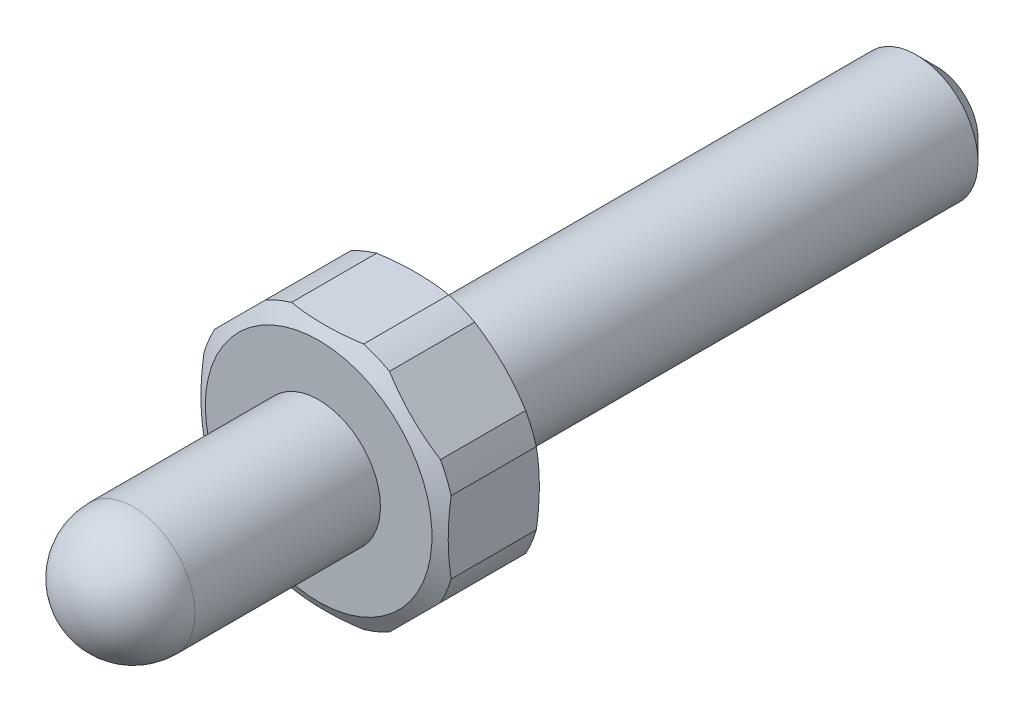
ISO-10303-21;
HEADER;
FILE_DESCRIPTION(('STEP AP214'),'2;1');
FILE_NAME('part.step','',(''),(''),'','','');
FILE_SCHEMA(('AUTOMOTIVE_DESIGN { 1 0 10303 214 1 1 1 1 }'));
ENDSEC;
DATA;
#1=APPLICATION_CONTEXT('core data for automotive mechanical design processes');
#2=APPLICATION_PROTOCOL_DEFINITION('international standard','automotive_design',2000,#1);
#3=PRODUCT_CONTEXT('',#1,'mechanical');
#4=PRODUCT('Part','Part','',(#3));
#5=PRODUCT_RELATED_PRODUCT_CATEGORY('part','',(#4));
#6=PRODUCT_DEFINITION_FORMATION('','',#4);
#7=PRODUCT_DEFINITION_CONTEXT('part definition',#1,'design');
#8=PRODUCT_DEFINITION('design','',#6,#7);
#9=PRODUCT_DEFINITION_SHAPE('','',#8);
#10=(LENGTH_UNIT() NAMED_UNIT(*) SI_UNIT(.MILLI.,.METRE.));
#11=(NAMED_UNIT(*) PLANE_ANGLE_UNIT() SI_UNIT($,.RADIAN.));
#12=(NAMED_UNIT(*) SI_UNIT($,.STERADIAN.) SOLID_ANGLE_UNIT());
#13=UNCERTAINTY_MEASURE_WITH_UNIT(LENGTH_MEASURE(1.E-05),#10,'distance_accuracy_value','');
#14=(GEOMETRIC_REPRESENTATION_CONTEXT(3) GLOBAL_UNCERTAINTY_ASSIGNED_CONTEXT((#13)) GLOBAL_UNIT_ASSIGNED_CONTEXT((#10,
#11,#12)) REPRESENTATION_CONTEXT('',''));
#15=CARTESIAN_POINT('',(0.,0.,0.));
#16=DIRECTION('',(0.,0.,1.));
#17=DIRECTION('',(1.,0.,0.));
#18=AXIS2_PLACEMENT_3D('',#15,#16,#17);
#19=CARTESIAN_POINT('',(-12.,4.97056274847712,60.));
#20=DIRECTION('',(-0.707106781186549,0.707106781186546,0.));
#21=DIRECTION('',(-0.707106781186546,-0.707106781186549,0.));
#22=AXIS2_PLACEMENT_3D('',#19,#20,#21);
#23=PLANE('',#22);
#24=CARTESIAN_POINT('',(-10.9603551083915,6.01020764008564,50.8660711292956));
#25=CARTESIAN_POINT('',(-10.7551775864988,6.21538516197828,50.8191285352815));
#26=CARTESIAN_POINT('',(-10.5493749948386,6.42118775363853,50.7774794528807));
#27=CARTESIAN_POINT('',(-10.1367512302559,6.8338115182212,50.7054403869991));
#28=CARTESIAN_POINT('',(-9.92992987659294,7.04063287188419,50.6750524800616));
#29=CARTESIAN_POINT('',(-9.51697288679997,7.45358986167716,50.6263902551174));
#30=CARTESIAN_POINT('',(-9.31084202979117,7.65972071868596,50.608035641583));
#31=CARTESIAN_POINT('',(-8.89823455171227,8.07232819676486,50.5835161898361));
#32=CARTESIAN_POINT('',(-8.69175796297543,8.2788047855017,50.5773502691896));
#33=CARTESIAN_POINT('',(-8.27880478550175,8.69175796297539,50.5773502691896));
#34=CARTESIAN_POINT('',(-8.07232819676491,8.89823455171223,50.5835161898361));
#35=CARTESIAN_POINT('',(-7.65972071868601,9.31084202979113,50.608035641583));
#36=CARTESIAN_POINT('',(-7.45358986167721,9.51697288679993,50.6263902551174));
#37=CARTESIAN_POINT('',(-7.04063287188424,9.9299298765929,50.6750524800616));
#38=CARTESIAN_POINT('',(-6.83381151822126,10.1367512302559,50.7054403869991));
#39=CARTESIAN_POINT('',(-6.42118775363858,10.5493749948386,50.7774794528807));
#40=CARTESIAN_POINT('',(-6.21538516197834,10.7551775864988,50.8191285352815));
#41=CARTESIAN_POINT('',(-6.01020764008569,10.9603551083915,50.8660711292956));
#42=B_SPLINE_CURVE_WITH_KNOTS('',3,(#24,#25,#26,#27,#28,#29,#30,#31,#32,#33,#34,#35,#36,#37,#38,
#39,#40,#41),.UNSPECIFIED.,.F.,.F.,(4,2,2,2,2,2,2,2,4),(0.,0.881804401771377,1.76377132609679,
2.63979150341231,3.515733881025,4.3916762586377,5.26769643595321,6.14966336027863,
7.03146776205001),.UNSPECIFIED.);
#43=CARTESIAN_POINT('',(-10.9601551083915,6.01040764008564,50.8660254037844));
#44=VERTEX_POINT('',#43);
#45=CARTESIAN_POINT('',(-6.01040764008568,10.9601551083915,50.8660254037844));
#46=VERTEX_POINT('',#45);
#47=EDGE_CURVE('E210',#44,#46,#42,.T.);
#48=ORIENTED_EDGE('',*,*,#47,.F.);
#49=DIRECTION('',(0.,0.,-1.));
#50=VECTOR('',#49,1.);
#51=CARTESIAN_POINT('',(-10.9601551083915,6.01040764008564,9.2545567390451));
#52=LINE('',#51,#50);
#53=CARTESIAN_POINT('',(-10.9601551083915,6.01040764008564,59.1339745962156));
#54=VERTEX_POINT('',#53);
#55=EDGE_CURVE('E311',#54,#44,#52,.T.);
#56=ORIENTED_EDGE('',*,*,#55,.F.);
#57=CARTESIAN_POINT('',(-6.01020764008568,10.9603551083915,59.1339288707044));
#58=CARTESIAN_POINT('',(-6.21538516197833,10.7551775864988,59.1808714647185));
#59=CARTESIAN_POINT('',(-6.42118775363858,10.5493749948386,59.2225205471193));
#60=CARTESIAN_POINT('',(-6.83381151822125,10.1367512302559,59.2945596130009));
#61=CARTESIAN_POINT('',(-7.04063287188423,9.92992987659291,59.3249475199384));
#62=CARTESIAN_POINT('',(-7.4535898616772,9.51697288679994,59.3736097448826));
#63=CARTESIAN_POINT('',(-7.659720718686,9.31084202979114,59.391964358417));
#64=CARTESIAN_POINT('',(-8.0723281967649,8.89823455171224,59.4164838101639));
#65=CARTESIAN_POINT('',(-8.27880478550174,8.69175796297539,59.4226497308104));
#66=CARTESIAN_POINT('',(-8.69175796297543,8.2788047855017,59.4226497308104));
#67=CARTESIAN_POINT('',(-8.89823455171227,8.07232819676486,59.4164838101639));
#68=CARTESIAN_POINT('',(-9.31084202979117,7.65972071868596,59.391964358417));
#69=CARTESIAN_POINT('',(-9.51697288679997,7.45358986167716,59.3736097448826));
#70=CARTESIAN_POINT('',(-9.92992987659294,7.04063287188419,59.3249475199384));
#71=CARTESIAN_POINT('',(-10.1367512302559,6.8338115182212,59.2945596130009));
#72=CARTESIAN_POINT('',(-10.5493749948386,6.42118775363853,59.2225205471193));
#73=CARTESIAN_POINT('',(-10.7551775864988,6.21538516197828,59.1808714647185));
#74=CARTESIAN_POINT('',(-10.9603551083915,6.01020764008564,59.1339288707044));
#75=B_SPLINE_CURVE_WITH_KNOTS('',3,(#57,#58,#59,#60,#61,#62,#63,#64,#65,#66,#67,#68,#69,#70,#71,
#72,#73,#74),.UNSPECIFIED.,.F.,.F.,(4,2,2,2,2,2,2,2,4),(0.,0.881804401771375,1.76377132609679,
2.63979150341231,3.515733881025,4.3916762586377,5.26769643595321,6.14966336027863,
7.03146776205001),.UNSPECIFIED.);
#76=CARTESIAN_POINT('',(-6.01040764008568,10.9601551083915,59.1339745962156));
#77=VERTEX_POINT('',#76);
#78=EDGE_CURVE('E202',#77,#54,#75,.T.);
#79=ORIENTED_EDGE('',*,*,#78,.F.);
#80=DIRECTION('',(0.,0.,-1.));
#81=VECTOR('',#80,1.);
#82=CARTESIAN_POINT('',(-6.01040764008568,10.9601551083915,9.2545567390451));
#83=LINE('',#82,#81);
#84=EDGE_CURVE('E317',#46,#77,#83,.F.);
#85=ORIENTED_EDGE('',*,*,#84,.F.);
#86=EDGE_LOOP('',(#48,#56,#79,#85));
#87=FACE_BOUND('',#86,.T.);
#88=ADVANCED_FACE('F14',(#87),#23,.T.);
#89=CARTESIAN_POINT('',(-12.,4.97056274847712,60.));
#90=DIRECTION('',(1.,0.,0.));
#91=DIRECTION('',(0.,1.,0.));
#92=AXIS2_PLACEMENT_3D('',#89,#90,#91);
#93=PLANE('',#92);
#94=DIRECTION('',(0.,0.,-1.));
#95=VECTOR('',#94,1.);
#96=CARTESIAN_POINT('',(-12.,3.5,9.2545567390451));
#97=LINE('',#96,#95);
#98=CARTESIAN_POINT('',(-12.,3.5,59.1339745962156));
#99=VERTEX_POINT('',#98);
#100=CARTESIAN_POINT('',(-12.,3.5,50.8660254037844));
#101=VERTEX_POINT('',#100);
#102=EDGE_CURVE('E134',#99,#101,#97,.T.);
#103=ORIENTED_EDGE('',*,*,#102,.T.);
#104=CARTESIAN_POINT('',(-12.,-12.8197186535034,53.787279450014));
#105=CARTESIAN_POINT('',(-12.,-12.6150530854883,53.7010148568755));
#106=CARTESIAN_POINT('',(-12.,-12.4100442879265,53.6155654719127));
#107=CARTESIAN_POINT('',(-12.,-11.9992831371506,53.4464602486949));
#108=CARTESIAN_POINT('',(-12.,-11.7935307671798,53.3628044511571));
#109=CARTESIAN_POINT('',(-12.,-11.174975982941,53.1147336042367));
#110=CARTESIAN_POINT('',(-12.,-10.7609856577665,52.9532615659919));
#111=CARTESIAN_POINT('',(-12.,-9.92713253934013,52.6389133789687));
#112=CARTESIAN_POINT('',(-12.,-9.5072499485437,52.4860895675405));
#113=CARTESIAN_POINT('',(-12.,-8.66346016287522,52.1920271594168));
#114=CARTESIAN_POINT('',(-12.,-8.23955327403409,52.0507876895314));
#115=CARTESIAN_POINT('',(-12.,-7.3947635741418,51.7846547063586));
#116=CARTESIAN_POINT('',(-12.,-6.97395775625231,51.6595183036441));
#117=CARTESIAN_POINT('',(-12.,-6.12780439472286,51.4254386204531));
#118=CARTESIAN_POINT('',(-12.,-5.70245662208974,51.3164961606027));
#119=CARTESIAN_POINT('',(-12.,-4.84814595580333,51.118015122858));
#120=CARTESIAN_POINT('',(-12.,-4.41919235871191,51.0284368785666));
#121=CARTESIAN_POINT('',(-12.,-3.55724803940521,50.871496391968));
#122=CARTESIAN_POINT('',(-12.,-3.1242580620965,50.8041301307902));
#123=CARTESIAN_POINT('',(-12.,-2.41341634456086,50.7143621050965));
#124=CARTESIAN_POINT('',(-12.,-2.13649209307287,50.6845197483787));
#125=CARTESIAN_POINT('',(-12.,-1.58170805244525,50.6354838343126));
#126=CARTESIAN_POINT('',(-12.,-1.30384832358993,50.6162896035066));
#127=CARTESIAN_POINT('',(-12.,-0.747527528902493,50.5889349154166));
#128=CARTESIAN_POINT('',(-12.,-0.469066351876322,50.5807767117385));
#129=CARTESIAN_POINT('',(-12.,0.0879628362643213,50.5756706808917));
#130=CARTESIAN_POINT('',(-12.,0.366530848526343,50.5787229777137));
#131=CARTESIAN_POINT('',(-12.,0.924466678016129,50.5960100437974));
#132=CARTESIAN_POINT('',(-12.,1.20383306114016,50.6102908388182));
#133=CARTESIAN_POINT('',(-12.,1.76178425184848,50.6497949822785));
#134=CARTESIAN_POINT('',(-12.,2.04036906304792,50.6750182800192));
#135=CARTESIAN_POINT('',(-12.,2.59631695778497,50.7359043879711));
#136=CARTESIAN_POINT('',(-12.,2.87368034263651,50.7715644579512));
#137=CARTESIAN_POINT('',(-12.,3.42699259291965,50.8526790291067));
#138=CARTESIAN_POINT('',(-12.,3.70294126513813,50.8981348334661));
#139=CARTESIAN_POINT('',(-12.,4.59340652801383,51.0599154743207));
#140=CARTESIAN_POINT('',(-12.,5.20467591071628,51.1943734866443));
#141=CARTESIAN_POINT('',(-12.,6.41801909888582,51.4996671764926));
#142=CARTESIAN_POINT('',(-12.,7.02008968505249,51.6705152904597));
#143=CARTESIAN_POINT('',(-12.,8.21751946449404,52.0410328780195));
#144=CARTESIAN_POINT('',(-12.,8.81284760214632,52.2408016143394));
#145=CARTESIAN_POINT('',(-12.,9.99559738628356,52.6620146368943));
#146=CARTESIAN_POINT('',(-12.,10.5830202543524,52.883455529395));
#147=CARTESIAN_POINT('',(-12.,11.750349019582,53.3425905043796));
#148=CARTESIAN_POINT('',(-12.,12.3302654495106,53.580257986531));
#149=CARTESIAN_POINT('',(-12.,13.4847022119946,54.0684050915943));
#150=CARTESIAN_POINT('',(-12.,14.0592221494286,54.3188856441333));
#151=CARTESIAN_POINT('',(-12.,15.1988573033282,54.8276364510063));
#152=CARTESIAN_POINT('',(-12.,15.7640109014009,55.085821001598));
#153=CARTESIAN_POINT('',(-12.,16.6089476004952,55.4789037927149));
#154=CARTESIAN_POINT('',(-12.,16.8900948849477,55.6108833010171));
#155=CARTESIAN_POINT('',(-12.,17.4515581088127,55.8765896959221));
#156=CARTESIAN_POINT('',(-12.,17.7318740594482,56.0103165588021));
#157=CARTESIAN_POINT('',(-12.,18.0118169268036,56.1448202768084));
#158=B_SPLINE_CURVE_WITH_KNOTS('',3,(#104,#105,#106,#107,#108,#109,#110,#111,#112,#113,#114,
#115,#116,#117,#118,#119,#120,#121,#122,#123,#124,#125,#126,#127,#128,#129,#130,#131,#132,#133,
#134,#135,#136,#137,#138,#139,#140,#141,#142,#143,#144,#145,#146,#147,#148,#149,#150,#151,#152,
#153,#154,#155,#156,#157),.UNSPECIFIED.,.F.,.F.,(4,2,2,2,2,2,2,2,2,2,2,2,2,2,2,2,2,2,2,2,2,2,2,
2,2,2,4),(0.,0.666304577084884,1.33262426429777,2.665621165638,4.00597208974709,
5.34622188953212,6.66300676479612,7.97985834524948,9.29398632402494,10.6078764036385,
11.4432777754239,12.2786263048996,13.1141453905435,13.9496737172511,14.7886448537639,
15.6276121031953,16.4663592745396,17.3052180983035,19.1812761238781,21.0579763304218,
22.9412776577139,24.8242845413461,26.7042754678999,28.5844029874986,30.4483323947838,
31.3800795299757,32.311814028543),.UNSPECIFIED.);
#159=CARTESIAN_POINT('',(-12.,-3.5,50.8660254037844));
#160=VERTEX_POINT('',#159);
#161=EDGE_CURVE('E126',#101,#160,#158,.F.);
#162=ORIENTED_EDGE('',*,*,#161,.T.);
#163=DIRECTION('',(0.,0.,-1.));
#164=VECTOR('',#163,1.);
#165=CARTESIAN_POINT('',(-12.,-3.5,9.2545567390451));
#166=LINE('',#165,#164);
#167=CARTESIAN_POINT('',(-12.,-3.5,59.1339745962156));
#168=VERTEX_POINT('',#167);
#169=EDGE_CURVE('E36',#160,#168,#166,.F.);
#170=ORIENTED_EDGE('',*,*,#169,.T.);
#171=CARTESIAN_POINT('',(-12.,-12.8197186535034,56.212720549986));
#172=CARTESIAN_POINT('',(-12.,-12.6150530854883,56.2989851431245));
#173=CARTESIAN_POINT('',(-12.,-12.4100442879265,56.3844345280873));
#174=CARTESIAN_POINT('',(-12.,-11.9992831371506,56.5535397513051));
#175=CARTESIAN_POINT('',(-12.,-11.7935307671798,56.6371955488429));
#176=CARTESIAN_POINT('',(-12.,-11.174975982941,56.8852663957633));
#177=CARTESIAN_POINT('',(-12.,-10.7609856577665,57.0467384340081));
#178=CARTESIAN_POINT('',(-12.,-9.92713253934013,57.3610866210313));
#179=CARTESIAN_POINT('',(-12.,-9.5072499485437,57.5139104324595));
#180=CARTESIAN_POINT('',(-12.,-8.66346016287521,57.8079728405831));
#181=CARTESIAN_POINT('',(-12.,-8.23955327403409,57.9492123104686));
#182=CARTESIAN_POINT('',(-12.,-7.39476357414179,58.2153452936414));
#183=CARTESIAN_POINT('',(-12.,-6.9739577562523,58.3404816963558));
#184=CARTESIAN_POINT('',(-12.,-6.12780439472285,58.5745613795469));
#185=CARTESIAN_POINT('',(-12.,-5.70245662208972,58.6835038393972));
#186=CARTESIAN_POINT('',(-12.,-4.84814595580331,58.881984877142));
#187=CARTESIAN_POINT('',(-12.,-4.4191923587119,58.9715631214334));
#188=CARTESIAN_POINT('',(-12.,-3.5572480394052,59.128503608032));
#189=CARTESIAN_POINT('',(-12.,-3.12425806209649,59.1958698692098));
#190=CARTESIAN_POINT('',(-12.,-2.41341634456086,59.2856378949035));
#191=CARTESIAN_POINT('',(-12.,-2.13649209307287,59.3154802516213));
#192=CARTESIAN_POINT('',(-12.,-1.58170805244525,59.3645161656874));
#193=CARTESIAN_POINT('',(-12.,-1.30384832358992,59.3837103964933));
#194=CARTESIAN_POINT('',(-12.,-0.74752752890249,59.4110650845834));
#195=CARTESIAN_POINT('',(-12.,-0.469066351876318,59.4192232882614));
#196=CARTESIAN_POINT('',(-12.,0.0879628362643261,59.4243293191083));
#197=CARTESIAN_POINT('',(-12.,0.366530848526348,59.4212770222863));
#198=CARTESIAN_POINT('',(-12.,0.924466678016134,59.4039899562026));
#199=CARTESIAN_POINT('',(-12.,1.20383306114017,59.3897091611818));
#200=CARTESIAN_POINT('',(-12.,1.76178425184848,59.3502050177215));
#201=CARTESIAN_POINT('',(-12.,2.04036906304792,59.3249817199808));
#202=CARTESIAN_POINT('',(-12.,2.59631695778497,59.2640956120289));
#203=CARTESIAN_POINT('',(-12.,2.87368034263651,59.2284355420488));
#204=CARTESIAN_POINT('',(-12.,3.42699259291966,59.1473209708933));
#205=CARTESIAN_POINT('',(-12.,3.70294126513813,59.1018651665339));
#206=CARTESIAN_POINT('',(-12.,4.59340652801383,58.9400845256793));
#207=CARTESIAN_POINT('',(-12.,5.20467591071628,58.8056265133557));
#208=CARTESIAN_POINT('',(-12.,6.41801909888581,58.5003328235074));
#209=CARTESIAN_POINT('',(-12.,7.02008968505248,58.3294847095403));
#210=CARTESIAN_POINT('',(-12.,8.21751946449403,57.9589671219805));
#211=CARTESIAN_POINT('',(-12.,8.81284760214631,57.7591983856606));
#212=CARTESIAN_POINT('',(-12.,9.99559738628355,57.3379853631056));
#213=CARTESIAN_POINT('',(-12.,10.5830202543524,57.116544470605));
#214=CARTESIAN_POINT('',(-12.,11.750349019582,56.6574094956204));
#215=CARTESIAN_POINT('',(-12.,12.3302654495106,56.419742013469));
#216=CARTESIAN_POINT('',(-12.,13.4847022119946,55.9315949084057));
#217=CARTESIAN_POINT('',(-12.,14.0592221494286,55.6811143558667));
#218=CARTESIAN_POINT('',(-12.,15.1988573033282,55.1723635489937));
#219=CARTESIAN_POINT('',(-12.,15.7640109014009,54.914178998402));
#220=CARTESIAN_POINT('',(-12.,16.6089476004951,54.5210962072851));
#221=CARTESIAN_POINT('',(-12.,16.8900948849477,54.3891166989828));
#222=CARTESIAN_POINT('',(-12.,17.4515581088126,54.1234103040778));
#223=CARTESIAN_POINT('',(-12.,17.7318740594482,53.9896834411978));
#224=CARTESIAN_POINT('',(-12.,18.0118169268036,53.8551797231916));
#225=B_SPLINE_CURVE_WITH_KNOTS('',3,(#171,#172,#173,#174,#175,#176,#177,#178,#179,#180,#181,
#182,#183,#184,#185,#186,#187,#188,#189,#190,#191,#192,#193,#194,#195,#196,#197,#198,#199,#200,
#201,#202,#203,#204,#205,#206,#207,#208,#209,#210,#211,#212,#213,#214,#215,#216,#217,#218,#219,
#220,#221,#222,#223,#224),.UNSPECIFIED.,.F.,.F.,(4,2,2,2,2,2,2,2,2,2,2,2,2,2,2,2,2,2,2,2,2,2,2,
2,2,2,4),(0.,0.666304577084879,1.33262426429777,2.665621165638,4.00597208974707,
5.34622188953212,6.66300676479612,7.97985834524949,9.29398632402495,10.6078764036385,
11.4432777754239,12.2786263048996,13.1141453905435,13.9496737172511,14.7886448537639,
15.6276121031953,16.4663592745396,17.3052180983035,19.1812761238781,21.0579763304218,
22.9412776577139,24.8242845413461,26.7042754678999,28.5844029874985,30.4483323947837,
31.3800795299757,32.311814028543),.UNSPECIFIED.);
#226=EDGE_CURVE('E353',#168,#99,#225,.T.);
#227=ORIENTED_EDGE('',*,*,#226,.T.);
#228=EDGE_LOOP('',(#103,#162,#170,#227));
#229=FACE_BOUND('',#228,.T.);
#230=ADVANCED_FACE('F132',(#229),#93,.F.);
#231=CARTESIAN_POINT('',(-12.,-4.97056274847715,60.));
#232=DIRECTION('',(0.707106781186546,0.707106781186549,0.));
#233=DIRECTION('',(-0.707106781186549,0.707106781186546,0.));
#234=AXIS2_PLACEMENT_3D('',#231,#232,#233);
#235=PLANE('',#234);
#236=DIRECTION('',(0.,0.,-1.));
#237=VECTOR('',#236,1.);
#238=CARTESIAN_POINT('',(-10.9601551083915,-6.01040764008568,9.2545567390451));
#239=LINE('',#238,#237);
#240=CARTESIAN_POINT('',(-10.9601551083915,-6.01040764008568,59.1339745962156));
#241=VERTEX_POINT('',#240);
#242=CARTESIAN_POINT('',(-10.9601551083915,-6.01040764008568,50.8660254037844));
#243=VERTEX_POINT('',#242);
#244=EDGE_CURVE('E140',#241,#243,#239,.T.);
#245=ORIENTED_EDGE('',*,*,#244,.T.);
#246=CARTESIAN_POINT('',(-10.9603551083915,-6.01020764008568,50.8660711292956));
#247=CARTESIAN_POINT('',(-10.7551775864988,-6.21538516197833,50.8191285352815));
#248=CARTESIAN_POINT('',(-10.5493749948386,-6.42118775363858,50.7774794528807));
#249=CARTESIAN_POINT('',(-10.1367512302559,-6.83381151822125,50.7054403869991));
#250=CARTESIAN_POINT('',(-9.92992987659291,-7.04063287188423,50.6750524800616));
#251=CARTESIAN_POINT('',(-9.51697288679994,-7.4535898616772,50.6263902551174));
#252=CARTESIAN_POINT('',(-9.31084202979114,-7.659720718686,50.608035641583));
#253=CARTESIAN_POINT('',(-8.89823455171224,-8.0723281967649,50.5835161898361));
#254=CARTESIAN_POINT('',(-8.69175796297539,-8.27880478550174,50.5773502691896));
#255=CARTESIAN_POINT('',(-8.2788047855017,-8.69175796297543,50.5773502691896));
#256=CARTESIAN_POINT('',(-8.07232819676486,-8.89823455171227,50.5835161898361));
#257=CARTESIAN_POINT('',(-7.65972071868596,-9.31084202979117,50.608035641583));
#258=CARTESIAN_POINT('',(-7.45358986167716,-9.51697288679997,50.6263902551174));
#259=CARTESIAN_POINT('',(-7.04063287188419,-9.92992987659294,50.6750524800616));
#260=CARTESIAN_POINT('',(-6.8338115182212,-10.1367512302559,50.7054403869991));
#261=CARTESIAN_POINT('',(-6.42118775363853,-10.5493749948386,50.7774794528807));
#262=CARTESIAN_POINT('',(-6.21538516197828,-10.7551775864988,50.8191285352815));
#263=CARTESIAN_POINT('',(-6.01020764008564,-10.9603551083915,50.8660711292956));
#264=B_SPLINE_CURVE_WITH_KNOTS('',3,(#246,#247,#248,#249,#250,#251,#252,#253,#254,#255,#256,
#257,#258,#259,#260,#261,#262,#263),.UNSPECIFIED.,.F.,.F.,(4,2,2,2,2,2,2,2,4),(0.,
0.881804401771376,1.76377132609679,2.63979150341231,3.51573388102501,4.3916762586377,
5.26769643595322,6.14966336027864,7.03146776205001),.UNSPECIFIED.);
#265=CARTESIAN_POINT('',(-6.01040764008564,-10.9601551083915,50.8660254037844));
#266=VERTEX_POINT('',#265);
#267=EDGE_CURVE('E29',#243,#266,#264,.T.);
#268=ORIENTED_EDGE('',*,*,#267,.T.);
#269=DIRECTION('',(0.,0.,-1.));
#270=VECTOR('',#269,1.);
#271=CARTESIAN_POINT('',(-6.01040764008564,-10.9601551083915,9.2545567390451));
#272=LINE('',#271,#270);
#273=CARTESIAN_POINT('',(-6.01040764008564,-10.9601551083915,59.1339745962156));
#274=VERTEX_POINT('',#273);
#275=EDGE_CURVE('E145',#266,#274,#272,.F.);
#276=ORIENTED_EDGE('',*,*,#275,.T.);
#277=CARTESIAN_POINT('',(-6.01020764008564,-10.9603551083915,59.1339288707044));
#278=CARTESIAN_POINT('',(-6.21538516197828,-10.7551775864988,59.1808714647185));
#279=CARTESIAN_POINT('',(-6.42118775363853,-10.5493749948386,59.2225205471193));
#280=CARTESIAN_POINT('',(-6.83381151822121,-10.1367512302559,59.2945596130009));
#281=CARTESIAN_POINT('',(-7.04063287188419,-9.92992987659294,59.3249475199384));
#282=CARTESIAN_POINT('',(-7.45358986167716,-9.51697288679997,59.3736097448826));
#283=CARTESIAN_POINT('',(-7.65972071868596,-9.31084202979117,59.391964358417));
#284=CARTESIAN_POINT('',(-8.07232819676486,-8.89823455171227,59.4164838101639));
#285=CARTESIAN_POINT('',(-8.2788047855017,-8.69175796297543,59.4226497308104));
#286=CARTESIAN_POINT('',(-8.69175796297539,-8.27880478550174,59.4226497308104));
#287=CARTESIAN_POINT('',(-8.89823455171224,-8.0723281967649,59.4164838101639));
#288=CARTESIAN_POINT('',(-9.31084202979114,-7.659720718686,59.391964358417));
#289=CARTESIAN_POINT('',(-9.51697288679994,-7.4535898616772,59.3736097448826));
#290=CARTESIAN_POINT('',(-9.92992987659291,-7.04063287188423,59.3249475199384));
#291=CARTESIAN_POINT('',(-10.1367512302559,-6.83381151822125,59.2945596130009));
#292=CARTESIAN_POINT('',(-10.5493749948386,-6.42118775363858,59.2225205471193));
#293=CARTESIAN_POINT('',(-10.7551775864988,-6.21538516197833,59.1808714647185));
#294=CARTESIAN_POINT('',(-10.9603551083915,-6.01020764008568,59.1339288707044));
#295=B_SPLINE_CURVE_WITH_KNOTS('',3,(#277,#278,#279,#280,#281,#282,#283,#284,#285,#286,#287,
#288,#289,#290,#291,#292,#293,#294),.UNSPECIFIED.,.F.,.F.,(4,2,2,2,2,2,2,2,4),(0.,
0.881804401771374,1.76377132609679,2.63979150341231,3.515733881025,4.3916762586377,
5.26769643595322,6.14966336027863,7.03146776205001),.UNSPECIFIED.);
#296=EDGE_CURVE('E344',#274,#241,#295,.T.);
#297=ORIENTED_EDGE('',*,*,#296,.T.);
#298=EDGE_LOOP('',(#245,#268,#276,#297));
#299=FACE_BOUND('',#298,.T.);
#300=ADVANCED_FACE('F190',(#299),#235,.F.);
#301=CARTESIAN_POINT('',(4.97056274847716,-12.,60.));
#302=DIRECTION('',(0.,-1.,0.));
#303=DIRECTION('',(0.,0.,-1.));
#304=AXIS2_PLACEMENT_3D('',#301,#302,#303);
#305=PLANE('',#304);
#306=CARTESIAN_POINT('',(-12.8197186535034,-12.,53.787279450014));
#307=CARTESIAN_POINT('',(-12.6150530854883,-12.,53.7010148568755));
#308=CARTESIAN_POINT('',(-12.4100442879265,-12.,53.6155654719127));
#309=CARTESIAN_POINT('',(-11.9992831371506,-12.,53.4464602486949));
#310=CARTESIAN_POINT('',(-11.7935307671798,-12.,53.3628044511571));
#311=CARTESIAN_POINT('',(-11.174975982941,-12.,53.1147336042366));
#312=CARTESIAN_POINT('',(-10.7609856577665,-12.,52.9532615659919));
#313=CARTESIAN_POINT('',(-9.92713253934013,-12.,52.6389133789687));
#314=CARTESIAN_POINT('',(-9.50724994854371,-12.,52.4860895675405));
#315=CARTESIAN_POINT('',(-8.66346016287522,-12.,52.1920271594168));
#316=CARTESIAN_POINT('',(-8.23955327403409,-12.,52.0507876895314));
#317=CARTESIAN_POINT('',(-7.3947635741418,-12.,51.7846547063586));
#318=CARTESIAN_POINT('',(-6.97395775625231,-12.,51.6595183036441));
#319=CARTESIAN_POINT('',(-6.12780439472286,-12.,51.4254386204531));
#320=CARTESIAN_POINT('',(-5.70245662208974,-12.,51.3164961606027));
#321=CARTESIAN_POINT('',(-4.84814595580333,-12.,51.118015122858));
#322=CARTESIAN_POINT('',(-4.41919235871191,-12.,51.0284368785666));
#323=CARTESIAN_POINT('',(-3.55724803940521,-12.,50.871496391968));
#324=CARTESIAN_POINT('',(-3.1242580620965,-12.,50.8041301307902));
#325=CARTESIAN_POINT('',(-2.41341634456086,-12.,50.7143621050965));
#326=CARTESIAN_POINT('',(-2.13649209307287,-12.,50.6845197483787));
#327=CARTESIAN_POINT('',(-1.58170805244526,-12.,50.6354838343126));
#328=CARTESIAN_POINT('',(-1.30384832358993,-12.,50.6162896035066));
#329=CARTESIAN_POINT('',(-0.747527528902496,-12.,50.5889349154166));
#330=CARTESIAN_POINT('',(-0.469066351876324,-12.,50.5807767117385));
#331=CARTESIAN_POINT('',(0.0879628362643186,-12.,50.5756706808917));
#332=CARTESIAN_POINT('',(0.36653084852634,-12.,50.5787229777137));
#333=CARTESIAN_POINT('',(0.924466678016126,-12.,50.5960100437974));
#334=CARTESIAN_POINT('',(1.20383306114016,-12.,50.6102908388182));
#335=CARTESIAN_POINT('',(1.76178425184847,-12.,50.6497949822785));
#336=CARTESIAN_POINT('',(2.04036906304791,-12.,50.6750182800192));
#337=CARTESIAN_POINT('',(2.59631695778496,-12.,50.7359043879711));
#338=CARTESIAN_POINT('',(2.8736803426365,-12.,50.7715644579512));
#339=CARTESIAN_POINT('',(3.42699259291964,-12.,50.8526790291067));
#340=CARTESIAN_POINT('',(3.70294126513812,-12.,50.8981348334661));
#341=CARTESIAN_POINT('',(4.59340652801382,-12.,51.0599154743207));
#342=CARTESIAN_POINT('',(5.20467591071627,-12.,51.1943734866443));
#343=CARTESIAN_POINT('',(6.41801909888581,-12.,51.4996671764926));
#344=CARTESIAN_POINT('',(7.02008968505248,-12.,51.6705152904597));
#345=CARTESIAN_POINT('',(8.21751946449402,-12.,52.0410328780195));
#346=CARTESIAN_POINT('',(8.8128476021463,-12.,52.2408016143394));
#347=CARTESIAN_POINT('',(9.99559738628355,-12.,52.6620146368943));
#348=CARTESIAN_POINT('',(10.5830202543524,-12.,52.883455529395));
#349=CARTESIAN_POINT('',(11.750349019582,-12.,53.3425905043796));
#350=CARTESIAN_POINT('',(12.3302654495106,-12.,53.580257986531));
#351=CARTESIAN_POINT('',(13.4847022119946,-12.,54.0684050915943));
#352=CARTESIAN_POINT('',(14.0592221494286,-12.,54.3188856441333));
#353=CARTESIAN_POINT('',(15.1988573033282,-12.,54.8276364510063));
#354=CARTESIAN_POINT('',(15.7640109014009,-12.,55.085821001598));
#355=CARTESIAN_POINT('',(16.6089476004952,-12.,55.4789037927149));
#356=CARTESIAN_POINT('',(16.8900948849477,-12.,55.6108833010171));
#357=CARTESIAN_POINT('',(17.4515581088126,-12.,55.8765896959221));
#358=CARTESIAN_POINT('',(17.7318740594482,-12.,56.0103165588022));
#359=CARTESIAN_POINT('',(18.0118169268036,-12.,56.1448202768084));
#360=B_SPLINE_CURVE_WITH_KNOTS('',3,(#306,#307,#308,#309,#310,#311,#312,#313,#314,#315,#316,
#317,#318,#319,#320,#321,#322,#323,#324,#325,#326,#327,#328,#329,#330,#331,#332,#333,#334,#335,
#336,#337,#338,#339,#340,#341,#342,#343,#344,#345,#346,#347,#348,#349,#350,#351,#352,#353,#354,
#355,#356,#357,#358,#359),.UNSPECIFIED.,.F.,.F.,(4,2,2,2,2,2,2,2,2,2,2,2,2,2,2,2,2,2,2,2,2,2,2,
2,2,2,4),(0.,0.666304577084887,1.33262426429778,2.66562116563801,4.00597208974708,
5.34622188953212,6.66300676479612,7.97985834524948,9.29398632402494,10.6078764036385,
11.4432777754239,12.2786263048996,13.1141453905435,13.9496737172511,14.7886448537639,
15.6276121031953,16.4663592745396,17.3052180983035,19.1812761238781,21.0579763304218,
22.9412776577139,24.8242845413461,26.7042754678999,28.5844029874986,30.4483323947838,
31.3800795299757,32.311814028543),.UNSPECIFIED.);
#361=CARTESIAN_POINT('',(3.5,-12.,50.8660254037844));
#362=VERTEX_POINT('',#361);
#363=CARTESIAN_POINT('',(-3.5,-12.,50.8660254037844));
#364=VERTEX_POINT('',#363);
#365=EDGE_CURVE('E219',#362,#364,#360,.F.);
#366=ORIENTED_EDGE('',*,*,#365,.F.);
#367=DIRECTION('',(0.,0.,-1.));
#368=VECTOR('',#367,1.);
#369=CARTESIAN_POINT('',(3.5,-12.,9.2545567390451));
#370=LINE('',#369,#368);
#371=CARTESIAN_POINT('',(3.5,-12.,59.1339745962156));
#372=VERTEX_POINT('',#371);
#373=EDGE_CURVE('E336',#372,#362,#370,.T.);
#374=ORIENTED_EDGE('',*,*,#373,.F.);
#375=CARTESIAN_POINT('',(-12.8197186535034,-12.,56.212720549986));
#376=CARTESIAN_POINT('',(-12.6150530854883,-12.,56.2989851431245));
#377=CARTESIAN_POINT('',(-12.4100442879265,-12.,56.3844345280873));
#378=CARTESIAN_POINT('',(-11.9992831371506,-12.,56.5535397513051));
#379=CARTESIAN_POINT('',(-11.7935307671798,-12.,56.6371955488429));
#380=CARTESIAN_POINT('',(-11.174975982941,-12.,56.8852663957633));
#381=CARTESIAN_POINT('',(-10.7609856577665,-12.,57.0467384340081));
#382=CARTESIAN_POINT('',(-9.92713253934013,-12.,57.3610866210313));
#383=CARTESIAN_POINT('',(-9.5072499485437,-12.,57.5139104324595));
#384=CARTESIAN_POINT('',(-8.66346016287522,-12.,57.8079728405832));
#385=CARTESIAN_POINT('',(-8.23955327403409,-12.,57.9492123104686));
#386=CARTESIAN_POINT('',(-7.3947635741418,-12.,58.2153452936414));
#387=CARTESIAN_POINT('',(-6.97395775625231,-12.,58.3404816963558));
#388=CARTESIAN_POINT('',(-6.12780439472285,-12.,58.5745613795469));
#389=CARTESIAN_POINT('',(-5.70245662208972,-12.,58.6835038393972));
#390=CARTESIAN_POINT('',(-4.84814595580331,-12.,58.881984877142));
#391=CARTESIAN_POINT('',(-4.4191923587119,-12.,58.9715631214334));
#392=CARTESIAN_POINT('',(-3.5572480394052,-12.,59.128503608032));
#393=CARTESIAN_POINT('',(-3.12425806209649,-12.,59.1958698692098));
#394=CARTESIAN_POINT('',(-2.41341634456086,-12.,59.2856378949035));
#395=CARTESIAN_POINT('',(-2.13649209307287,-12.,59.3154802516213));
#396=CARTESIAN_POINT('',(-1.58170805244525,-12.,59.3645161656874));
#397=CARTESIAN_POINT('',(-1.30384832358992,-12.,59.3837103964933));
#398=CARTESIAN_POINT('',(-0.74752752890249,-12.,59.4110650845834));
#399=CARTESIAN_POINT('',(-0.469066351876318,-12.,59.4192232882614));
#400=CARTESIAN_POINT('',(0.087962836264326,-12.,59.4243293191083));
#401=CARTESIAN_POINT('',(0.366530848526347,-12.,59.4212770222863));
#402=CARTESIAN_POINT('',(0.924466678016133,-12.,59.4039899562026));
#403=CARTESIAN_POINT('',(1.20383306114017,-12.,59.3897091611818));
#404=CARTESIAN_POINT('',(1.76178425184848,-12.,59.3502050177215));
#405=CARTESIAN_POINT('',(2.04036906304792,-12.,59.3249817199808));
#406=CARTESIAN_POINT('',(2.59631695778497,-12.,59.2640956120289));
#407=CARTESIAN_POINT('',(2.87368034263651,-12.,59.2284355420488));
#408=CARTESIAN_POINT('',(3.42699259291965,-12.,59.1473209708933));
#409=CARTESIAN_POINT('',(3.70294126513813,-12.,59.1018651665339));
#410=CARTESIAN_POINT('',(4.59340652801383,-12.,58.9400845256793));
#411=CARTESIAN_POINT('',(5.20467591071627,-12.,58.8056265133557));
#412=CARTESIAN_POINT('',(6.4180190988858,-12.,58.5003328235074));
#413=CARTESIAN_POINT('',(7.02008968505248,-12.,58.3294847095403));
#414=CARTESIAN_POINT('',(8.21751946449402,-12.,57.9589671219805));
#415=CARTESIAN_POINT('',(8.8128476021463,-12.,57.7591983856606));
#416=CARTESIAN_POINT('',(9.99559738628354,-12.,57.3379853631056));
#417=CARTESIAN_POINT('',(10.5830202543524,-12.,57.116544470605));
#418=CARTESIAN_POINT('',(11.750349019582,-12.,56.6574094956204));
#419=CARTESIAN_POINT('',(12.3302654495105,-12.,56.419742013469));
#420=CARTESIAN_POINT('',(13.4847022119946,-12.,55.9315949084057));
#421=CARTESIAN_POINT('',(14.0592221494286,-12.,55.6811143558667));
#422=CARTESIAN_POINT('',(15.1988573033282,-12.,55.1723635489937));
#423=CARTESIAN_POINT('',(15.7640109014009,-12.,54.914178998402));
#424=CARTESIAN_POINT('',(16.6089476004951,-12.,54.5210962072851));
#425=CARTESIAN_POINT('',(16.8900948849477,-12.,54.3891166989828));
#426=CARTESIAN_POINT('',(17.4515581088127,-12.,54.1234103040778));
#427=CARTESIAN_POINT('',(17.7318740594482,-12.,53.9896834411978));
#428=CARTESIAN_POINT('',(18.0118169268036,-12.,53.8551797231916));
#429=B_SPLINE_CURVE_WITH_KNOTS('',3,(#375,#376,#377,#378,#379,#380,#381,#382,#383,#384,#385,
#386,#387,#388,#389,#390,#391,#392,#393,#394,#395,#396,#397,#398,#399,#400,#401,#402,#403,#404,
#405,#406,#407,#408,#409,#410,#411,#412,#413,#414,#415,#416,#417,#418,#419,#420,#421,#422,#423,
#424,#425,#426,#427,#428),.UNSPECIFIED.,.F.,.F.,(4,2,2,2,2,2,2,2,2,2,2,2,2,2,2,2,2,2,2,2,2,2,2,
2,2,2,4),(0.,0.666304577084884,1.33262426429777,2.665621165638,4.00597208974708,
5.34622188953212,6.66300676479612,7.97985834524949,9.29398632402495,10.6078764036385,
11.4432777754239,12.2786263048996,13.1141453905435,13.9496737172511,14.7886448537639,
15.6276121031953,16.4663592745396,17.3052180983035,19.1812761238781,21.0579763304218,
22.9412776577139,24.8242845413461,26.7042754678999,28.5844029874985,30.4483323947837,
31.3800795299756,32.311814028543),.UNSPECIFIED.);
#430=CARTESIAN_POINT('',(-3.5,-12.,59.1339745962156));
#431=VERTEX_POINT('',#430);
#432=EDGE_CURVE('E361',#431,#372,#429,.T.);
#433=ORIENTED_EDGE('',*,*,#432,.F.);
#434=DIRECTION('',(0.,0.,-1.));
#435=VECTOR('',#434,1.);
#436=CARTESIAN_POINT('',(-3.5,-12.,9.2545567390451));
#437=LINE('',#436,#435);
#438=EDGE_CURVE('E339',#364,#431,#437,.F.);
#439=ORIENTED_EDGE('',*,*,#438,.F.);
#440=EDGE_LOOP('',(#366,#374,#433,#439));
#441=FACE_BOUND('',#440,.T.);
#442=ADVANCED_FACE('F372',(#441),#305,.T.);
#443=CARTESIAN_POINT('',(4.97056274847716,-12.,60.));
#444=DIRECTION('',(-0.707106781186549,0.707106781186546,0.));
#445=DIRECTION('',(-0.707106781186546,-0.707106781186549,0.));
#446=AXIS2_PLACEMENT_3D('',#443,#444,#445);
#447=PLANE('',#446);
#448=DIRECTION('',(0.,0.,-1.));
#449=VECTOR('',#448,1.);
#450=CARTESIAN_POINT('',(6.0104076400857,-10.9601551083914,9.2545567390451));
#451=LINE('',#450,#449);
#452=CARTESIAN_POINT('',(6.01040764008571,-10.9601551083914,59.1339745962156));
#453=VERTEX_POINT('',#452);
#454=CARTESIAN_POINT('',(6.01040764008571,-10.9601551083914,50.8660254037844));
#455=VERTEX_POINT('',#454);
#456=EDGE_CURVE('E333',#453,#455,#451,.T.);
#457=ORIENTED_EDGE('',*,*,#456,.T.);
#458=CARTESIAN_POINT('',(6.0102076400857,-10.9603551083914,50.8660711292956));
#459=CARTESIAN_POINT('',(6.21538516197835,-10.7551775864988,50.8191285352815));
#460=CARTESIAN_POINT('',(6.4211877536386,-10.5493749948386,50.7774794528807));
#461=CARTESIAN_POINT('',(6.83381151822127,-10.1367512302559,50.7054403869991));
#462=CARTESIAN_POINT('',(7.04063287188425,-9.9299298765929,50.6750524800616));
#463=CARTESIAN_POINT('',(7.45358986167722,-9.51697288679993,50.6263902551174));
#464=CARTESIAN_POINT('',(7.65972071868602,-9.31084202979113,50.608035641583));
#465=CARTESIAN_POINT('',(8.07232819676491,-8.89823455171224,50.5835161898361));
#466=CARTESIAN_POINT('',(8.27880478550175,-8.69175796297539,50.5773502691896));
#467=CARTESIAN_POINT('',(8.69175796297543,-8.27880478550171,50.5773502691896));
#468=CARTESIAN_POINT('',(8.89823455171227,-8.07232819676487,50.5835161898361));
#469=CARTESIAN_POINT('',(9.31084202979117,-7.65972071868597,50.608035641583));
#470=CARTESIAN_POINT('',(9.51697288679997,-7.45358986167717,50.6263902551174));
#471=CARTESIAN_POINT('',(9.92992987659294,-7.0406328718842,50.6750524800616));
#472=CARTESIAN_POINT('',(10.1367512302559,-6.83381151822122,50.7054403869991));
#473=CARTESIAN_POINT('',(10.5493749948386,-6.42118775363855,50.7774794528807));
#474=CARTESIAN_POINT('',(10.7551775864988,-6.2153851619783,50.8191285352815));
#475=CARTESIAN_POINT('',(10.9603551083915,-6.01020764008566,50.8660711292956));
#476=B_SPLINE_CURVE_WITH_KNOTS('',3,(#458,#459,#460,#461,#462,#463,#464,#465,#466,#467,#468,
#469,#470,#471,#472,#473,#474,#475),.UNSPECIFIED.,.F.,.F.,(4,2,2,2,2,2,2,2,4),(0.,
0.88180440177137,1.76377132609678,2.63979150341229,3.51573388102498,4.39167625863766,
5.26769643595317,6.14966336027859,7.03146776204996),.UNSPECIFIED.);
#477=CARTESIAN_POINT('',(10.9601551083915,-6.01040764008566,50.8660254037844));
#478=VERTEX_POINT('',#477);
#479=EDGE_CURVE('E260',#455,#478,#476,.T.);
#480=ORIENTED_EDGE('',*,*,#479,.T.);
#481=DIRECTION('',(0.,0.,-1.));
#482=VECTOR('',#481,1.);
#483=CARTESIAN_POINT('',(10.9601551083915,-6.01040764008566,9.2545567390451));
#484=LINE('',#483,#482);
#485=CARTESIAN_POINT('',(10.9601551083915,-6.01040764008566,59.1339745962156));
#486=VERTEX_POINT('',#485);
#487=EDGE_CURVE('E331',#478,#486,#484,.F.);
#488=ORIENTED_EDGE('',*,*,#487,.T.);
#489=CARTESIAN_POINT('',(10.9603551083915,-6.01020764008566,59.1339288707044));
#490=CARTESIAN_POINT('',(10.7551775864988,-6.21538516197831,59.1808714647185));
#491=CARTESIAN_POINT('',(10.5493749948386,-6.42118775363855,59.2225205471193));
#492=CARTESIAN_POINT('',(10.1367512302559,-6.83381151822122,59.2945596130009));
#493=CARTESIAN_POINT('',(9.92992987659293,-7.04063287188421,59.3249475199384));
#494=CARTESIAN_POINT('',(9.51697288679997,-7.45358986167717,59.3736097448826));
#495=CARTESIAN_POINT('',(9.31084202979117,-7.65972071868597,59.391964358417));
#496=CARTESIAN_POINT('',(8.89823455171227,-8.07232819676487,59.4164838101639));
#497=CARTESIAN_POINT('',(8.69175796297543,-8.27880478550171,59.4226497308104));
#498=CARTESIAN_POINT('',(8.27880478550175,-8.69175796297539,59.4226497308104));
#499=CARTESIAN_POINT('',(8.07232819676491,-8.89823455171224,59.4164838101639));
#500=CARTESIAN_POINT('',(7.65972071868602,-9.31084202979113,59.391964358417));
#501=CARTESIAN_POINT('',(7.45358986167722,-9.51697288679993,59.3736097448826));
#502=CARTESIAN_POINT('',(7.04063287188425,-9.9299298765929,59.3249475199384));
#503=CARTESIAN_POINT('',(6.83381151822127,-10.1367512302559,59.2945596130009));
#504=CARTESIAN_POINT('',(6.4211877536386,-10.5493749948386,59.2225205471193));
#505=CARTESIAN_POINT('',(6.21538516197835,-10.7551775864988,59.1808714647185));
#506=CARTESIAN_POINT('',(6.0102076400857,-10.9603551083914,59.1339288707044));
#507=B_SPLINE_CURVE_WITH_KNOTS('',3,(#489,#490,#491,#492,#493,#494,#495,#496,#497,#498,#499,
#500,#501,#502,#503,#504,#505,#506),.UNSPECIFIED.,.F.,.F.,(4,2,2,2,2,2,2,2,4),(0.,
0.88180440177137,1.76377132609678,2.63979150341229,3.51573388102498,4.39167625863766,
5.26769643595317,6.14966336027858,7.03146776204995),.UNSPECIFIED.);
#508=EDGE_CURVE('E418',#486,#453,#507,.T.);
#509=ORIENTED_EDGE('',*,*,#508,.T.);
#510=EDGE_LOOP('',(#457,#480,#488,#509));
#511=FACE_BOUND('',#510,.T.);
#512=ADVANCED_FACE('F375',(#511),#447,.F.);
#513=CARTESIAN_POINT('',(12.,4.97056274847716,60.));
#514=DIRECTION('',(1.,0.,0.));
#515=DIRECTION('',(0.,0.,-1.));
#516=AXIS2_PLACEMENT_3D('',#513,#514,#515);
#517=PLANE('',#516);
#518=CARTESIAN_POINT('',(12.,-12.8197186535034,53.787279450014));
#519=CARTESIAN_POINT('',(12.,-12.6150530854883,53.7010148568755));
#520=CARTESIAN_POINT('',(12.,-12.4100442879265,53.6155654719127));
#521=CARTESIAN_POINT('',(12.,-11.9992831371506,53.4464602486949));
#522=CARTESIAN_POINT('',(12.,-11.7935307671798,53.3628044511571));
#523=CARTESIAN_POINT('',(12.,-11.174975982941,53.1147336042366));
#524=CARTESIAN_POINT('',(12.,-10.7609856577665,52.9532615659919));
#525=CARTESIAN_POINT('',(12.,-9.92713253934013,52.6389133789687));
#526=CARTESIAN_POINT('',(12.,-9.50724994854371,52.4860895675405));
#527=CARTESIAN_POINT('',(12.,-8.66346016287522,52.1920271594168));
#528=CARTESIAN_POINT('',(12.,-8.23955327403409,52.0507876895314));
#529=CARTESIAN_POINT('',(12.,-7.3947635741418,51.7846547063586));
#530=CARTESIAN_POINT('',(12.,-6.97395775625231,51.6595183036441));
#531=CARTESIAN_POINT('',(12.,-6.12780439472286,51.4254386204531));
#532=CARTESIAN_POINT('',(12.,-5.70245662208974,51.3164961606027));
#533=CARTESIAN_POINT('',(12.,-4.84814595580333,51.118015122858));
#534=CARTESIAN_POINT('',(12.,-4.41919235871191,51.0284368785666));
#535=CARTESIAN_POINT('',(12.,-3.55724803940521,50.871496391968));
#536=CARTESIAN_POINT('',(12.,-3.1242580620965,50.8041301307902));
#537=CARTESIAN_POINT('',(12.,-2.41341634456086,50.7143621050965));
#538=CARTESIAN_POINT('',(12.,-2.13649209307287,50.6845197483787));
#539=CARTESIAN_POINT('',(12.,-1.58170805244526,50.6354838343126));
#540=CARTESIAN_POINT('',(12.,-1.30384832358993,50.6162896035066));
#541=CARTESIAN_POINT('',(12.,-0.747527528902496,50.5889349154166));
#542=CARTESIAN_POINT('',(12.,-0.469066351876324,50.5807767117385));
#543=CARTESIAN_POINT('',(12.,0.0879628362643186,50.5756706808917));
#544=CARTESIAN_POINT('',(12.,0.36653084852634,50.5787229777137));
#545=CARTESIAN_POINT('',(12.,0.924466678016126,50.5960100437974));
#546=CARTESIAN_POINT('',(12.,1.20383306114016,50.6102908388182));
#547=CARTESIAN_POINT('',(12.,1.76178425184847,50.6497949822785));
#548=CARTESIAN_POINT('',(12.,2.04036906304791,50.6750182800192));
#549=CARTESIAN_POINT('',(12.,2.59631695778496,50.7359043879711));
#550=CARTESIAN_POINT('',(12.,2.8736803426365,50.7715644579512));
#551=CARTESIAN_POINT('',(12.,3.42699259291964,50.8526790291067));
#552=CARTESIAN_POINT('',(12.,3.70294126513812,50.8981348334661));
#553=CARTESIAN_POINT('',(12.,4.59340652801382,51.0599154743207));
#554=CARTESIAN_POINT('',(12.,5.20467591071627,51.1943734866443));
#555=CARTESIAN_POINT('',(12.,6.41801909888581,51.4996671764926));
#556=CARTESIAN_POINT('',(12.,7.02008968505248,51.6705152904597));
#557=CARTESIAN_POINT('',(12.,8.21751946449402,52.0410328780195));
#558=CARTESIAN_POINT('',(12.,8.8128476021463,52.2408016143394));
#559=CARTESIAN_POINT('',(12.,9.99559738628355,52.6620146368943));
#560=CARTESIAN_POINT('',(12.,10.5830202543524,52.883455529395));
#561=CARTESIAN_POINT('',(12.,11.750349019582,53.3425905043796));
#562=CARTESIAN_POINT('',(12.,12.3302654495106,53.580257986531));
#563=CARTESIAN_POINT('',(12.,13.4847022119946,54.0684050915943));
#564=CARTESIAN_POINT('',(12.,14.0592221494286,54.3188856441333));
#565=CARTESIAN_POINT('',(12.,15.1988573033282,54.8276364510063));
#566=CARTESIAN_POINT('',(12.,15.7640109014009,55.085821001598));
#567=CARTESIAN_POINT('',(12.,16.6089476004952,55.4789037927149));
#568=CARTESIAN_POINT('',(12.,16.8900948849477,55.6108833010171));
#569=CARTESIAN_POINT('',(12.,17.4515581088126,55.8765896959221));
#570=CARTESIAN_POINT('',(12.,17.7318740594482,56.0103165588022));
#571=CARTESIAN_POINT('',(12.,18.0118169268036,56.1448202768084));
#572=B_SPLINE_CURVE_WITH_KNOTS('',3,(#518,#519,#520,#521,#522,#523,#524,#525,#526,#527,#528,
#529,#530,#531,#532,#533,#534,#535,#536,#537,#538,#539,#540,#541,#542,#543,#544,#545,#546,#547,
#548,#549,#550,#551,#552,#553,#554,#555,#556,#557,#558,#559,#560,#561,#562,#563,#564,#565,#566,
#567,#568,#569,#570,#571),.UNSPECIFIED.,.F.,.F.,(4,2,2,2,2,2,2,2,2,2,2,2,2,2,2,2,2,2,2,2,2,2,2,
2,2,2,4),(0.,0.666304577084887,1.33262426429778,2.66562116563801,4.00597208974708,
5.34622188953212,6.66300676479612,7.97985834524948,9.29398632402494,10.6078764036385,
11.4432777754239,12.2786263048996,13.1141453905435,13.9496737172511,14.7886448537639,
15.6276121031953,16.4663592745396,17.3052180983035,19.1812761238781,21.0579763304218,
22.9412776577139,24.8242845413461,26.7042754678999,28.5844029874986,30.4483323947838,
31.3800795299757,32.311814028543),.UNSPECIFIED.);
#573=CARTESIAN_POINT('',(12.,3.5,50.8660254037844));
#574=VERTEX_POINT('',#573);
#575=CARTESIAN_POINT('',(12.,-3.5,50.8660254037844));
#576=VERTEX_POINT('',#575);
#577=EDGE_CURVE('E275',#574,#576,#572,.F.);
#578=ORIENTED_EDGE('',*,*,#577,.F.);
#579=DIRECTION('',(0.,0.,-1.));
#580=VECTOR('',#579,1.);
#581=CARTESIAN_POINT('',(12.,3.5,9.2545567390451));
#582=LINE('',#581,#580);
#583=CARTESIAN_POINT('',(12.,3.5,59.1339745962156));
#584=VERTEX_POINT('',#583);
#585=EDGE_CURVE('E326',#584,#574,#582,.T.);
#586=ORIENTED_EDGE('',*,*,#585,.F.);
#587=CARTESIAN_POINT('',(12.,-12.8197186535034,56.212720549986));
#588=CARTESIAN_POINT('',(12.,-12.6150530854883,56.2989851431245));
#589=CARTESIAN_POINT('',(12.,-12.4100442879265,56.3844345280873));
#590=CARTESIAN_POINT('',(12.,-11.9992831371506,56.5535397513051));
#591=CARTESIAN_POINT('',(12.,-11.7935307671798,56.6371955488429));
#592=CARTESIAN_POINT('',(12.,-11.174975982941,56.8852663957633));
#593=CARTESIAN_POINT('',(12.,-10.7609856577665,57.0467384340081));
#594=CARTESIAN_POINT('',(12.,-9.92713253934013,57.3610866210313));
#595=CARTESIAN_POINT('',(12.,-9.5072499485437,57.5139104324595));
#596=CARTESIAN_POINT('',(12.,-8.66346016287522,57.8079728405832));
#597=CARTESIAN_POINT('',(12.,-8.23955327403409,57.9492123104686));
#598=CARTESIAN_POINT('',(12.,-7.3947635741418,58.2153452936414));
#599=CARTESIAN_POINT('',(12.,-6.97395775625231,58.3404816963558));
#600=CARTESIAN_POINT('',(12.,-6.12780439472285,58.5745613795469));
#601=CARTESIAN_POINT('',(12.,-5.70245662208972,58.6835038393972));
#602=CARTESIAN_POINT('',(12.,-4.84814595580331,58.881984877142));
#603=CARTESIAN_POINT('',(12.,-4.4191923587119,58.9715631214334));
#604=CARTESIAN_POINT('',(12.,-3.5572480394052,59.128503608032));
#605=CARTESIAN_POINT('',(12.,-3.12425806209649,59.1958698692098));
#606=CARTESIAN_POINT('',(12.,-2.41341634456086,59.2856378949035));
#607=CARTESIAN_POINT('',(12.,-2.13649209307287,59.3154802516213));
#608=CARTESIAN_POINT('',(12.,-1.58170805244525,59.3645161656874));
#609=CARTESIAN_POINT('',(12.,-1.30384832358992,59.3837103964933));
#610=CARTESIAN_POINT('',(12.,-0.74752752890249,59.4110650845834));
#611=CARTESIAN_POINT('',(12.,-0.469066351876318,59.4192232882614));
#612=CARTESIAN_POINT('',(12.,0.087962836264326,59.4243293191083));
#613=CARTESIAN_POINT('',(12.,0.366530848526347,59.4212770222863));
#614=CARTESIAN_POINT('',(12.,0.924466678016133,59.4039899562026));
#615=CARTESIAN_POINT('',(12.,1.20383306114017,59.3897091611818));
#616=CARTESIAN_POINT('',(12.,1.76178425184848,59.3502050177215));
#617=CARTESIAN_POINT('',(12.,2.04036906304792,59.3249817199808));
#618=CARTESIAN_POINT('',(12.,2.59631695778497,59.2640956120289));
#619=CARTESIAN_POINT('',(12.,2.87368034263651,59.2284355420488));
#620=CARTESIAN_POINT('',(12.,3.42699259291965,59.1473209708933));
#621=CARTESIAN_POINT('',(12.,3.70294126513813,59.1018651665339));
#622=CARTESIAN_POINT('',(12.,4.59340652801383,58.9400845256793));
#623=CARTESIAN_POINT('',(12.,5.20467591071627,58.8056265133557));
#624=CARTESIAN_POINT('',(12.,6.4180190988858,58.5003328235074));
#625=CARTESIAN_POINT('',(12.,7.02008968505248,58.3294847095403));
#626=CARTESIAN_POINT('',(12.,8.21751946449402,57.9589671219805));
#627=CARTESIAN_POINT('',(12.,8.8128476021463,57.7591983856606));
#628=CARTESIAN_POINT('',(12.,9.99559738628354,57.3379853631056));
#629=CARTESIAN_POINT('',(12.,10.5830202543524,57.116544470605));
#630=CARTESIAN_POINT('',(12.,11.750349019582,56.6574094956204));
#631=CARTESIAN_POINT('',(12.,12.3302654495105,56.419742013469));
#632=CARTESIAN_POINT('',(12.,13.4847022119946,55.9315949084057));
#633=CARTESIAN_POINT('',(12.,14.0592221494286,55.6811143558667));
#634=CARTESIAN_POINT('',(12.,15.1988573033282,55.1723635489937));
#635=CARTESIAN_POINT('',(12.,15.7640109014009,54.914178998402));
#636=CARTESIAN_POINT('',(12.,16.6089476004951,54.5210962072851));
#637=CARTESIAN_POINT('',(12.,16.8900948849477,54.3891166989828));
#638=CARTESIAN_POINT('',(12.,17.4515581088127,54.1234103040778));
#639=CARTESIAN_POINT('',(12.,17.7318740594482,53.9896834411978));
#640=CARTESIAN_POINT('',(12.,18.0118169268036,53.8551797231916));
#641=B_SPLINE_CURVE_WITH_KNOTS('',3,(#587,#588,#589,#590,#591,#592,#593,#594,#595,#596,#597,
#598,#599,#600,#601,#602,#603,#604,#605,#606,#607,#608,#609,#610,#611,#612,#613,#614,#615,#616,
#617,#618,#619,#620,#621,#622,#623,#624,#625,#626,#627,#628,#629,#630,#631,#632,#633,#634,#635,
#636,#637,#638,#639,#640),.UNSPECIFIED.,.F.,.F.,(4,2,2,2,2,2,2,2,2,2,2,2,2,2,2,2,2,2,2,2,2,2,2,
2,2,2,4),(0.,0.666304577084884,1.33262426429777,2.665621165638,4.00597208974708,
5.34622188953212,6.66300676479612,7.97985834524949,9.29398632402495,10.6078764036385,
11.4432777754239,12.2786263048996,13.1141453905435,13.9496737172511,14.7886448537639,
15.6276121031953,16.4663592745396,17.3052180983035,19.1812761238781,21.0579763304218,
22.9412776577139,24.8242845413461,26.7042754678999,28.5844029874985,30.4483323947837,
31.3800795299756,32.311814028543),.UNSPECIFIED.);
#642=CARTESIAN_POINT('',(12.,-3.5,59.1339745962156));
#643=VERTEX_POINT('',#642);
#644=EDGE_CURVE('E299',#643,#584,#641,.T.);
#645=ORIENTED_EDGE('',*,*,#644,.F.);
#646=DIRECTION('',(0.,0.,-1.));
#647=VECTOR('',#646,1.);
#648=CARTESIAN_POINT('',(12.,-3.5,9.2545567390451));
#649=LINE('',#648,#647);
#650=EDGE_CURVE('E329',#576,#643,#649,.F.);
#651=ORIENTED_EDGE('',*,*,#650,.F.);
#652=EDGE_LOOP('',(#578,#586,#645,#651));
#653=FACE_BOUND('',#652,.T.);
#654=ADVANCED_FACE('F286',(#653),#517,.T.);
#655=CARTESIAN_POINT('',(12.,4.97056274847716,60.));
#656=DIRECTION('',(-0.707106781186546,-0.707106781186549,0.));
#657=DIRECTION('',(0.707106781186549,-0.707106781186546,0.));
#658=AXIS2_PLACEMENT_3D('',#655,#656,#657);
#659=PLANE('',#658);
#660=DIRECTION('',(0.,0.,-1.));
#661=VECTOR('',#660,1.);
#662=CARTESIAN_POINT('',(10.9601551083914,6.0104076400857,9.2545567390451));
#663=LINE('',#662,#661);
#664=CARTESIAN_POINT('',(10.9601551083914,6.01040764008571,59.1339745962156));
#665=VERTEX_POINT('',#664);
#666=CARTESIAN_POINT('',(10.9601551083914,6.01040764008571,50.8660254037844));
#667=VERTEX_POINT('',#666);
#668=EDGE_CURVE('E323',#665,#667,#663,.T.);
#669=ORIENTED_EDGE('',*,*,#668,.T.);
#670=CARTESIAN_POINT('',(10.9603551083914,6.0102076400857,50.8660711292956));
#671=CARTESIAN_POINT('',(10.7551775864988,6.21538516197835,50.8191285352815));
#672=CARTESIAN_POINT('',(10.5493749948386,6.4211877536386,50.7774794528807));
#673=CARTESIAN_POINT('',(10.1367512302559,6.83381151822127,50.7054403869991));
#674=CARTESIAN_POINT('',(9.9299298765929,7.04063287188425,50.6750524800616));
#675=CARTESIAN_POINT('',(9.51697288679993,7.45358986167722,50.6263902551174));
#676=CARTESIAN_POINT('',(9.31084202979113,7.65972071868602,50.608035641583));
#677=CARTESIAN_POINT('',(8.89823455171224,8.07232819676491,50.5835161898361));
#678=CARTESIAN_POINT('',(8.69175796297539,8.27880478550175,50.5773502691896));
#679=CARTESIAN_POINT('',(8.27880478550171,8.69175796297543,50.5773502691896));
#680=CARTESIAN_POINT('',(8.07232819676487,8.89823455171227,50.5835161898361));
#681=CARTESIAN_POINT('',(7.65972071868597,9.31084202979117,50.608035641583));
#682=CARTESIAN_POINT('',(7.45358986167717,9.51697288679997,50.6263902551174));
#683=CARTESIAN_POINT('',(7.0406328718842,9.92992987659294,50.6750524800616));
#684=CARTESIAN_POINT('',(6.83381151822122,10.1367512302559,50.7054403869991));
#685=CARTESIAN_POINT('',(6.42118775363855,10.5493749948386,50.7774794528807));
#686=CARTESIAN_POINT('',(6.2153851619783,10.7551775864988,50.8191285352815));
#687=CARTESIAN_POINT('',(6.01020764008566,10.9603551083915,50.8660711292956));
#688=B_SPLINE_CURVE_WITH_KNOTS('',3,(#670,#671,#672,#673,#674,#675,#676,#677,#678,#679,#680,
#681,#682,#683,#684,#685,#686,#687),.UNSPECIFIED.,.F.,.F.,(4,2,2,2,2,2,2,2,4),(0.,
0.88180440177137,1.76377132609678,2.63979150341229,3.51573388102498,4.39167625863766,
5.26769643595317,6.14966336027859,7.03146776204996),.UNSPECIFIED.);
#689=CARTESIAN_POINT('',(6.01040764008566,10.9601551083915,50.8660254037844));
#690=VERTEX_POINT('',#689);
#691=EDGE_CURVE('E268',#667,#690,#688,.T.);
#692=ORIENTED_EDGE('',*,*,#691,.T.);
#693=DIRECTION('',(0.,0.,-1.));
#694=VECTOR('',#693,1.);
#695=CARTESIAN_POINT('',(6.01040764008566,10.9601551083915,9.2545567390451));
#696=LINE('',#695,#694);
#697=CARTESIAN_POINT('',(6.01040764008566,10.9601551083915,59.1339745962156));
#698=VERTEX_POINT('',#697);
#699=EDGE_CURVE('E321',#690,#698,#696,.F.);
#700=ORIENTED_EDGE('',*,*,#699,.T.);
#701=CARTESIAN_POINT('',(6.01020764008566,10.9603551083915,59.1339288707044));
#702=CARTESIAN_POINT('',(6.21538516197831,10.7551775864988,59.1808714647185));
#703=CARTESIAN_POINT('',(6.42118775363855,10.5493749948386,59.2225205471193));
#704=CARTESIAN_POINT('',(6.83381151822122,10.1367512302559,59.2945596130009));
#705=CARTESIAN_POINT('',(7.04063287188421,9.92992987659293,59.3249475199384));
#706=CARTESIAN_POINT('',(7.45358986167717,9.51697288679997,59.3736097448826));
#707=CARTESIAN_POINT('',(7.65972071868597,9.31084202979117,59.391964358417));
#708=CARTESIAN_POINT('',(8.07232819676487,8.89823455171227,59.4164838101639));
#709=CARTESIAN_POINT('',(8.27880478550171,8.69175796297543,59.4226497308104));
#710=CARTESIAN_POINT('',(8.69175796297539,8.27880478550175,59.4226497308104));
#711=CARTESIAN_POINT('',(8.89823455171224,8.07232819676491,59.4164838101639));
#712=CARTESIAN_POINT('',(9.31084202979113,7.65972071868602,59.391964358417));
#713=CARTESIAN_POINT('',(9.51697288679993,7.45358986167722,59.3736097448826));
#714=CARTESIAN_POINT('',(9.9299298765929,7.04063287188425,59.3249475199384));
#715=CARTESIAN_POINT('',(10.1367512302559,6.83381151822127,59.2945596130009));
#716=CARTESIAN_POINT('',(10.5493749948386,6.4211877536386,59.2225205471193));
#717=CARTESIAN_POINT('',(10.7551775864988,6.21538516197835,59.1808714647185));
#718=CARTESIAN_POINT('',(10.9603551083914,6.0102076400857,59.1339288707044));
#719=B_SPLINE_CURVE_WITH_KNOTS('',3,(#701,#702,#703,#704,#705,#706,#707,#708,#709,#710,#711,
#712,#713,#714,#715,#716,#717,#718),.UNSPECIFIED.,.F.,.F.,(4,2,2,2,2,2,2,2,4),(0.,
0.88180440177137,1.76377132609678,2.63979150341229,3.51573388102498,4.39167625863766,
5.26769643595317,6.14966336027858,7.03146776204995),.UNSPECIFIED.);
#720=EDGE_CURVE('E291',#698,#665,#719,.T.);
#721=ORIENTED_EDGE('',*,*,#720,.T.);
#722=EDGE_LOOP('',(#669,#692,#700,#721));
#723=FACE_BOUND('',#722,.T.);
#724=ADVANCED_FACE('F283',(#723),#659,.F.);
#725=CARTESIAN_POINT('',(-4.97056274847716,12.,60.));
#726=DIRECTION('',(0.,1.,0.));
#727=DIRECTION('',(0.,0.,1.));
#728=AXIS2_PLACEMENT_3D('',#725,#726,#727);
#729=PLANE('',#728);
#730=CARTESIAN_POINT('',(-12.8197186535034,12.,53.787279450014));
#731=CARTESIAN_POINT('',(-12.6150530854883,12.,53.7010148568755));
#732=CARTESIAN_POINT('',(-12.4100442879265,12.,53.6155654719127));
#733=CARTESIAN_POINT('',(-11.9992831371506,12.,53.4464602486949));
#734=CARTESIAN_POINT('',(-11.7935307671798,12.,53.3628044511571));
#735=CARTESIAN_POINT('',(-11.174975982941,12.,53.1147336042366));
#736=CARTESIAN_POINT('',(-10.7609856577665,12.,52.9532615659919));
#737=CARTESIAN_POINT('',(-9.92713253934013,12.,52.6389133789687));
#738=CARTESIAN_POINT('',(-9.50724994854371,12.,52.4860895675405));
#739=CARTESIAN_POINT('',(-8.66346016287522,12.,52.1920271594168));
#740=CARTESIAN_POINT('',(-8.23955327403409,12.,52.0507876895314));
#741=CARTESIAN_POINT('',(-7.3947635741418,12.,51.7846547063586));
#742=CARTESIAN_POINT('',(-6.97395775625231,12.,51.6595183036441));
#743=CARTESIAN_POINT('',(-6.12780439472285,12.,51.4254386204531));
#744=CARTESIAN_POINT('',(-5.70245662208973,12.,51.3164961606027));
#745=CARTESIAN_POINT('',(-4.84814595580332,12.,51.118015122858));
#746=CARTESIAN_POINT('',(-4.4191923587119,12.,51.0284368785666));
#747=CARTESIAN_POINT('',(-3.5572480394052,12.,50.871496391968));
#748=CARTESIAN_POINT('',(-3.12425806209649,12.,50.8041301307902));
#749=CARTESIAN_POINT('',(-2.41341634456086,12.,50.7143621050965));
#750=CARTESIAN_POINT('',(-2.13649209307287,12.,50.6845197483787));
#751=CARTESIAN_POINT('',(-1.58170805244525,12.,50.6354838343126));
#752=CARTESIAN_POINT('',(-1.30384832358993,12.,50.6162896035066));
#753=CARTESIAN_POINT('',(-0.747527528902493,12.,50.5889349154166));
#754=CARTESIAN_POINT('',(-0.469066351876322,12.,50.5807767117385));
#755=CARTESIAN_POINT('',(0.0879628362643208,12.,50.5756706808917));
#756=CARTESIAN_POINT('',(0.366530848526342,12.,50.5787229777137));
#757=CARTESIAN_POINT('',(0.924466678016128,12.,50.5960100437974));
#758=CARTESIAN_POINT('',(1.20383306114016,12.,50.6102908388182));
#759=CARTESIAN_POINT('',(1.76178425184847,12.,50.6497949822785));
#760=CARTESIAN_POINT('',(2.04036906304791,12.,50.6750182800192));
#761=CARTESIAN_POINT('',(2.59631695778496,12.,50.7359043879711));
#762=CARTESIAN_POINT('',(2.8736803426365,12.,50.7715644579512));
#763=CARTESIAN_POINT('',(3.42699259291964,12.,50.8526790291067));
#764=CARTESIAN_POINT('',(3.70294126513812,12.,50.8981348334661));
#765=CARTESIAN_POINT('',(4.59340652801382,12.,51.0599154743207));
#766=CARTESIAN_POINT('',(5.20467591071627,12.,51.1943734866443));
#767=CARTESIAN_POINT('',(6.4180190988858,12.,51.4996671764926));
#768=CARTESIAN_POINT('',(7.02008968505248,12.,51.6705152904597));
#769=CARTESIAN_POINT('',(8.21751946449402,12.,52.0410328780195));
#770=CARTESIAN_POINT('',(8.8128476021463,12.,52.2408016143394));
#771=CARTESIAN_POINT('',(9.99559738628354,12.,52.6620146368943));
#772=CARTESIAN_POINT('',(10.5830202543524,12.,52.883455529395));
#773=CARTESIAN_POINT('',(11.750349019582,12.,53.3425905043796));
#774=CARTESIAN_POINT('',(12.3302654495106,12.,53.580257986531));
#775=CARTESIAN_POINT('',(13.4847022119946,12.,54.0684050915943));
#776=CARTESIAN_POINT('',(14.0592221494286,12.,54.3188856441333));
#777=CARTESIAN_POINT('',(15.1988573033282,12.,54.8276364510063));
#778=CARTESIAN_POINT('',(15.7640109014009,12.,55.085821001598));
#779=CARTESIAN_POINT('',(16.6089476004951,12.,55.4789037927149));
#780=CARTESIAN_POINT('',(16.8900948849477,12.,55.6108833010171));
#781=CARTESIAN_POINT('',(17.4515581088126,12.,55.8765896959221));
#782=CARTESIAN_POINT('',(17.7318740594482,12.,56.0103165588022));
#783=CARTESIAN_POINT('',(18.0118169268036,12.,56.1448202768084));
#784=B_SPLINE_CURVE_WITH_KNOTS('',3,(#730,#731,#732,#733,#734,#735,#736,#737,#738,#739,#740,
#741,#742,#743,#744,#745,#746,#747,#748,#749,#750,#751,#752,#753,#754,#755,#756,#757,#758,#759,
#760,#761,#762,#763,#764,#765,#766,#767,#768,#769,#770,#771,#772,#773,#774,#775,#776,#777,#778,
#779,#780,#781,#782,#783),.UNSPECIFIED.,.F.,.F.,(4,2,2,2,2,2,2,2,2,2,2,2,2,2,2,2,2,2,2,2,2,2,2,
2,2,2,4),(0.,0.666304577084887,1.33262426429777,2.66562116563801,4.00597208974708,
5.34622188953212,6.66300676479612,7.97985834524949,9.29398632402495,10.6078764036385,
11.4432777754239,12.2786263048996,13.1141453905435,13.9496737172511,14.7886448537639,
15.6276121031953,16.4663592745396,17.3052180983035,19.1812761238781,21.0579763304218,
22.9412776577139,24.8242845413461,26.7042754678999,28.5844029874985,30.4483323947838,
31.3800795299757,32.311814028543),.UNSPECIFIED.);
#785=CARTESIAN_POINT('',(-3.5,12.,50.8660254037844));
#786=VERTEX_POINT('',#785);
#787=CARTESIAN_POINT('',(3.5,12.,50.8660254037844));
#788=VERTEX_POINT('',#787);
#789=EDGE_CURVE('E254',#786,#788,#784,.T.);
#790=ORIENTED_EDGE('',*,*,#789,.F.);
#791=DIRECTION('',(0.,0.,-1.));
#792=VECTOR('',#791,1.);
#793=CARTESIAN_POINT('',(-3.5,12.,9.2545567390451));
#794=LINE('',#793,#792);
#795=CARTESIAN_POINT('',(-3.5,12.,59.1339745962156));
#796=VERTEX_POINT('',#795);
#797=EDGE_CURVE('E314',#796,#786,#794,.T.);
#798=ORIENTED_EDGE('',*,*,#797,.F.);
#799=CARTESIAN_POINT('',(-12.8197186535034,12.,56.212720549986));
#800=CARTESIAN_POINT('',(-12.6150530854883,12.,56.2989851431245));
#801=CARTESIAN_POINT('',(-12.4100442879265,12.,56.3844345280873));
#802=CARTESIAN_POINT('',(-11.9992831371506,12.,56.5535397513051));
#803=CARTESIAN_POINT('',(-11.7935307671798,12.,56.6371955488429));
#804=CARTESIAN_POINT('',(-11.174975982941,12.,56.8852663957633));
#805=CARTESIAN_POINT('',(-10.7609856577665,12.,57.0467384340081));
#806=CARTESIAN_POINT('',(-9.92713253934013,12.,57.3610866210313));
#807=CARTESIAN_POINT('',(-9.5072499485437,12.,57.5139104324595));
#808=CARTESIAN_POINT('',(-8.66346016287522,12.,57.8079728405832));
#809=CARTESIAN_POINT('',(-8.23955327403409,12.,57.9492123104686));
#810=CARTESIAN_POINT('',(-7.3947635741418,12.,58.2153452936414));
#811=CARTESIAN_POINT('',(-6.97395775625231,12.,58.3404816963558));
#812=CARTESIAN_POINT('',(-6.12780439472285,12.,58.5745613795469));
#813=CARTESIAN_POINT('',(-5.70245662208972,12.,58.6835038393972));
#814=CARTESIAN_POINT('',(-4.84814595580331,12.,58.881984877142));
#815=CARTESIAN_POINT('',(-4.4191923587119,12.,58.9715631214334));
#816=CARTESIAN_POINT('',(-3.5572480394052,12.,59.128503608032));
#817=CARTESIAN_POINT('',(-3.12425806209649,12.,59.1958698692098));
#818=CARTESIAN_POINT('',(-2.41341634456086,12.,59.2856378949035));
#819=CARTESIAN_POINT('',(-2.13649209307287,12.,59.3154802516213));
#820=CARTESIAN_POINT('',(-1.58170805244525,12.,59.3645161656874));
#821=CARTESIAN_POINT('',(-1.30384832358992,12.,59.3837103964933));
#822=CARTESIAN_POINT('',(-0.74752752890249,12.,59.4110650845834));
#823=CARTESIAN_POINT('',(-0.469066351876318,12.,59.4192232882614));
#824=CARTESIAN_POINT('',(0.087962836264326,12.,59.4243293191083));
#825=CARTESIAN_POINT('',(0.366530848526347,12.,59.4212770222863));
#826=CARTESIAN_POINT('',(0.924466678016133,12.,59.4039899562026));
#827=CARTESIAN_POINT('',(1.20383306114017,12.,59.3897091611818));
#828=CARTESIAN_POINT('',(1.76178425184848,12.,59.3502050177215));
#829=CARTESIAN_POINT('',(2.04036906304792,12.,59.3249817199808));
#830=CARTESIAN_POINT('',(2.59631695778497,12.,59.2640956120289));
#831=CARTESIAN_POINT('',(2.87368034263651,12.,59.2284355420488));
#832=CARTESIAN_POINT('',(3.42699259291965,12.,59.1473209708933));
#833=CARTESIAN_POINT('',(3.70294126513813,12.,59.1018651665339));
#834=CARTESIAN_POINT('',(4.59340652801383,12.,58.9400845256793));
#835=CARTESIAN_POINT('',(5.20467591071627,12.,58.8056265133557));
#836=CARTESIAN_POINT('',(6.4180190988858,12.,58.5003328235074));
#837=CARTESIAN_POINT('',(7.02008968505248,12.,58.3294847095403));
#838=CARTESIAN_POINT('',(8.21751946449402,12.,57.9589671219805));
#839=CARTESIAN_POINT('',(8.8128476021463,12.,57.7591983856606));
#840=CARTESIAN_POINT('',(9.99559738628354,12.,57.3379853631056));
#841=CARTESIAN_POINT('',(10.5830202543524,12.,57.116544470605));
#842=CARTESIAN_POINT('',(11.750349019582,12.,56.6574094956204));
#843=CARTESIAN_POINT('',(12.3302654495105,12.,56.419742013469));
#844=CARTESIAN_POINT('',(13.4847022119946,12.,55.9315949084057));
#845=CARTESIAN_POINT('',(14.0592221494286,12.,55.6811143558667));
#846=CARTESIAN_POINT('',(15.1988573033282,12.,55.1723635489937));
#847=CARTESIAN_POINT('',(15.7640109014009,12.,54.914178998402));
#848=CARTESIAN_POINT('',(16.6089476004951,12.,54.5210962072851));
#849=CARTESIAN_POINT('',(16.8900948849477,12.,54.3891166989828));
#850=CARTESIAN_POINT('',(17.4515581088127,12.,54.1234103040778));
#851=CARTESIAN_POINT('',(17.7318740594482,12.,53.9896834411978));
#852=CARTESIAN_POINT('',(18.0118169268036,12.,53.8551797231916));
#853=B_SPLINE_CURVE_WITH_KNOTS('',3,(#799,#800,#801,#802,#803,#804,#805,#806,#807,#808,#809,
#810,#811,#812,#813,#814,#815,#816,#817,#818,#819,#820,#821,#822,#823,#824,#825,#826,#827,#828,
#829,#830,#831,#832,#833,#834,#835,#836,#837,#838,#839,#840,#841,#842,#843,#844,#845,#846,#847,
#848,#849,#850,#851,#852),.UNSPECIFIED.,.F.,.F.,(4,2,2,2,2,2,2,2,2,2,2,2,2,2,2,2,2,2,2,2,2,2,2,
2,2,2,4),(0.,0.666304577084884,1.33262426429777,2.665621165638,4.00597208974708,
5.34622188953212,6.66300676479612,7.97985834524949,9.29398632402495,10.6078764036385,
11.4432777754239,12.2786263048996,13.1141453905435,13.9496737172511,14.7886448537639,
15.6276121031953,16.4663592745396,17.3052180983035,19.1812761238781,21.0579763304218,
22.9412776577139,24.8242845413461,26.7042754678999,28.5844029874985,30.4483323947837,
31.3800795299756,32.311814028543),.UNSPECIFIED.);
#854=CARTESIAN_POINT('',(3.5,12.,59.1339745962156));
#855=VERTEX_POINT('',#854);
#856=EDGE_CURVE('E420',#855,#796,#853,.F.);
#857=ORIENTED_EDGE('',*,*,#856,.F.);
#858=DIRECTION('',(0.,0.,-1.));
#859=VECTOR('',#858,1.);
#860=CARTESIAN_POINT('',(3.5,12.,9.2545567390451));
#861=LINE('',#860,#859);
#862=EDGE_CURVE('E319',#788,#855,#861,.F.);
#863=ORIENTED_EDGE('',*,*,#862,.F.);
#864=EDGE_LOOP('',(#790,#798,#857,#863));
#865=FACE_BOUND('',#864,.T.);
#866=ADVANCED_FACE('F197',(#865),#729,.T.);
#867=CARTESIAN_POINT('',(0.,0.,9.2545567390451));
#868=DIRECTION('',(0.,0.,-1.));
#869=DIRECTION('',(-1.,0.,0.));
#870=AXIS2_PLACEMENT_3D('',#867,#868,#869);
#871=CYLINDRICAL_SURFACE('',#870,12.5);
#872=ORIENTED_EDGE('',*,*,#55,.T.);
#873=CARTESIAN_POINT('',(0.,0.,50.8660254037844));
#874=DIRECTION('',(0.,0.,1.));
#875=DIRECTION('',(1.,0.,0.));
#876=AXIS2_PLACEMENT_3D('',#873,#874,#875);
#877=CIRCLE('',#876,12.5);
#878=EDGE_CURVE('E448',#44,#101,#877,.T.);
#879=ORIENTED_EDGE('',*,*,#878,.T.);
#880=ORIENTED_EDGE('',*,*,#102,.F.);
#881=CARTESIAN_POINT('',(0.,0.,59.1339745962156));
#882=DIRECTION('',(0.,0.,-1.));
#883=DIRECTION('',(-1.,0.,0.));
#884=AXIS2_PLACEMENT_3D('',#881,#882,#883);
#885=CIRCLE('',#884,12.5);
#886=EDGE_CURVE('E358',#99,#54,#885,.T.);
#887=ORIENTED_EDGE('',*,*,#886,.T.);
#888=EDGE_LOOP('',(#872,#879,#880,#887));
#889=FACE_BOUND('',#888,.T.);
#890=ADVANCED_FACE('F444',(#889),#871,.T.);
#891=ORIENTED_EDGE('',*,*,#797,.T.);
#892=CARTESIAN_POINT('',(0.,0.,50.8660254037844));
#893=DIRECTION('',(0.,0.,1.));
#894=DIRECTION('',(1.,0.,0.));
#895=AXIS2_PLACEMENT_3D('',#892,#893,#894);
#896=CIRCLE('',#895,12.5);
#897=EDGE_CURVE('E446',#786,#46,#896,.T.);
#898=ORIENTED_EDGE('',*,*,#897,.T.);
#899=ORIENTED_EDGE('',*,*,#84,.T.);
#900=CARTESIAN_POINT('',(0.,0.,59.1339745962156));
#901=DIRECTION('',(0.,0.,-1.));
#902=DIRECTION('',(-1.,0.,0.));
#903=AXIS2_PLACEMENT_3D('',#900,#901,#902);
#904=CIRCLE('',#903,12.5);
#905=EDGE_CURVE('E432',#77,#796,#904,.T.);
#906=ORIENTED_EDGE('',*,*,#905,.T.);
#907=EDGE_LOOP('',(#891,#898,#899,#906));
#908=FACE_BOUND('',#907,.T.);
#909=ADVANCED_FACE('F450',(#908),#871,.T.);
#910=ORIENTED_EDGE('',*,*,#699,.F.);
#911=CARTESIAN_POINT('',(0.,0.,50.8660254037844));
#912=DIRECTION('',(0.,0.,1.));
#913=DIRECTION('',(1.,0.,0.));
#914=AXIS2_PLACEMENT_3D('',#911,#912,#913);
#915=CIRCLE('',#914,12.5);
#916=EDGE_CURVE('E276',#690,#788,#915,.T.);
#917=ORIENTED_EDGE('',*,*,#916,.T.);
#918=ORIENTED_EDGE('',*,*,#862,.T.);
#919=CARTESIAN_POINT('',(0.,0.,59.1339745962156));
#920=DIRECTION('',(0.,0.,-1.));
#921=DIRECTION('',(-1.,0.,0.));
#922=AXIS2_PLACEMENT_3D('',#919,#920,#921);
#923=CIRCLE('',#922,12.5);
#924=EDGE_CURVE('E300',#855,#698,#923,.T.);
#925=ORIENTED_EDGE('',*,*,#924,.T.);
#926=EDGE_LOOP('',(#910,#917,#918,#925));
#927=FACE_BOUND('',#926,.T.);
#928=ADVANCED_FACE('F415',(#927),#871,.T.);
#929=ORIENTED_EDGE('',*,*,#585,.T.);
#930=CARTESIAN_POINT('',(0.,0.,50.8660254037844));
#931=DIRECTION('',(0.,0.,1.));
#932=DIRECTION('',(1.,0.,0.));
#933=AXIS2_PLACEMENT_3D('',#930,#931,#932);
#934=CIRCLE('',#933,12.5);
#935=EDGE_CURVE('E390',#574,#667,#934,.T.);
#936=ORIENTED_EDGE('',*,*,#935,.T.);
#937=ORIENTED_EDGE('',*,*,#668,.F.);
#938=CARTESIAN_POINT('',(0.,0.,59.1339745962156));
#939=DIRECTION('',(0.,0.,-1.));
#940=DIRECTION('',(-1.,0.,0.));
#941=AXIS2_PLACEMENT_3D('',#938,#939,#940);
#942=CIRCLE('',#941,12.5);
#943=EDGE_CURVE('E307',#665,#584,#942,.T.);
#944=ORIENTED_EDGE('',*,*,#943,.T.);
#945=EDGE_LOOP('',(#929,#936,#937,#944));
#946=FACE_BOUND('',#945,.T.);
#947=ADVANCED_FACE('F409',(#946),#871,.T.);
#948=ORIENTED_EDGE('',*,*,#487,.F.);
#949=CARTESIAN_POINT('',(0.,0.,50.8660254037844));
#950=DIRECTION('',(0.,0.,1.));
#951=DIRECTION('',(1.,0.,0.));
#952=AXIS2_PLACEMENT_3D('',#949,#950,#951);
#953=CIRCLE('',#952,12.5);
#954=EDGE_CURVE('E396',#478,#576,#953,.T.);
#955=ORIENTED_EDGE('',*,*,#954,.T.);
#956=ORIENTED_EDGE('',*,*,#650,.T.);
#957=CARTESIAN_POINT('',(0.,0.,59.1339745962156));
#958=DIRECTION('',(0.,0.,-1.));
#959=DIRECTION('',(-1.,0.,0.));
#960=AXIS2_PLACEMENT_3D('',#957,#958,#959);
#961=CIRCLE('',#960,12.5);
#962=EDGE_CURVE('E408',#643,#486,#961,.T.);
#963=ORIENTED_EDGE('',*,*,#962,.T.);
#964=EDGE_LOOP('',(#948,#955,#956,#963));
#965=FACE_BOUND('',#964,.T.);
#966=ADVANCED_FACE('F403',(#965),#871,.T.);
#967=ORIENTED_EDGE('',*,*,#373,.T.);
#968=CARTESIAN_POINT('',(0.,0.,50.8660254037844));
#969=DIRECTION('',(0.,0.,1.));
#970=DIRECTION('',(1.,0.,0.));
#971=AXIS2_PLACEMENT_3D('',#968,#969,#970);
#972=CIRCLE('',#971,12.5);
#973=EDGE_CURVE('E218',#362,#455,#972,.T.);
#974=ORIENTED_EDGE('',*,*,#973,.T.);
#975=ORIENTED_EDGE('',*,*,#456,.F.);
#976=CARTESIAN_POINT('',(0.,0.,59.1339745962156));
#977=DIRECTION('',(0.,0.,-1.));
#978=DIRECTION('',(-1.,0.,0.));
#979=AXIS2_PLACEMENT_3D('',#976,#977,#978);
#980=CIRCLE('',#979,12.5);
#981=EDGE_CURVE('E434',#453,#372,#980,.T.);
#982=ORIENTED_EDGE('',*,*,#981,.T.);
#983=EDGE_LOOP('',(#967,#974,#975,#982));
#984=FACE_BOUND('',#983,.T.);
#985=ADVANCED_FACE('F453',(#984),#871,.T.);
#986=ORIENTED_EDGE('',*,*,#275,.F.);
#987=CARTESIAN_POINT('',(0.,0.,50.8660254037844));
#988=DIRECTION('',(0.,0.,1.));
#989=DIRECTION('',(1.,0.,0.));
#990=AXIS2_PLACEMENT_3D('',#987,#988,#989);
#991=CIRCLE('',#990,12.5);
#992=EDGE_CURVE('E135',#266,#364,#991,.T.);
#993=ORIENTED_EDGE('',*,*,#992,.T.);
#994=ORIENTED_EDGE('',*,*,#438,.T.);
#995=CARTESIAN_POINT('',(0.,0.,59.1339745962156));
#996=DIRECTION('',(0.,0.,-1.));
#997=DIRECTION('',(-1.,0.,0.));
#998=AXIS2_PLACEMENT_3D('',#995,#996,#997);
#999=CIRCLE('',#998,12.5);
#1000=EDGE_CURVE('E351',#431,#274,#999,.T.);
#1001=ORIENTED_EDGE('',*,*,#1000,.T.);
#1002=EDGE_LOOP('',(#986,#993,#994,#1001));
#1003=FACE_BOUND('',#1002,.T.);
#1004=ADVANCED_FACE('F356',(#1003),#871,.T.);
#1005=ORIENTED_EDGE('',*,*,#169,.F.);
#1006=CARTESIAN_POINT('',(0.,0.,50.8660254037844));
#1007=DIRECTION('',(0.,0.,1.));
#1008=DIRECTION('',(1.,0.,0.));
#1009=AXIS2_PLACEMENT_3D('',#1006,#1007,#1008);
#1010=CIRCLE('',#1009,12.5);
#1011=EDGE_CURVE('E9',#160,#243,#1010,.T.);
#1012=ORIENTED_EDGE('',*,*,#1011,.T.);
#1013=ORIENTED_EDGE('',*,*,#244,.F.);
#1014=CARTESIAN_POINT('',(0.,0.,59.1339745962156));
#1015=DIRECTION('',(0.,0.,-1.));
#1016=DIRECTION('',(-1.,0.,0.));
#1017=AXIS2_PLACEMENT_3D('',#1014,#1015,#1016);
#1018=CIRCLE('',#1017,12.5);
#1019=EDGE_CURVE('E22',#241,#168,#1018,.T.);
#1020=ORIENTED_EDGE('',*,*,#1019,.T.);
#1021=EDGE_LOOP('',(#1005,#1012,#1013,#1020));
#1022=FACE_BOUND('',#1021,.T.);
#1023=ADVANCED_FACE('F138',(#1022),#871,.T.);
#1024=CARTESIAN_POINT('',(0.,0.,60.));
#1025=DIRECTION('',(0.,0.,-1.));
#1026=DIRECTION('',(-1.,0.,0.));
#1027=AXIS2_PLACEMENT_3D('',#1024,#1025,#1026);
#1028=CONICAL_SURFACE('',#1027,11.,1.0471975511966);
#1029=CARTESIAN_POINT('',(0.,0.,60.));
#1030=DIRECTION('',(0.,0.,-1.));
#1031=DIRECTION('',(-1.,0.,0.));
#1032=AXIS2_PLACEMENT_3D('',#1029,#1030,#1031);
#1033=CIRCLE('',#1032,11.);
#1034=CARTESIAN_POINT('',(-11.,0.,60.));
#1035=VERTEX_POINT('',#1034);
#1036=EDGE_CURVE('E354',#1035,#1035,#1033,.T.);
#1037=ORIENTED_EDGE('',*,*,#1036,.T.);
#1038=EDGE_LOOP('',(#1037));
#1039=FACE_BOUND('',#1038,.T.);
#1040=ORIENTED_EDGE('',*,*,#720,.F.);
#1041=ORIENTED_EDGE('',*,*,#924,.F.);
#1042=ORIENTED_EDGE('',*,*,#856,.T.);
#1043=ORIENTED_EDGE('',*,*,#905,.F.);
#1044=ORIENTED_EDGE('',*,*,#78,.T.);
#1045=ORIENTED_EDGE('',*,*,#886,.F.);
#1046=ORIENTED_EDGE('',*,*,#226,.F.);
#1047=ORIENTED_EDGE('',*,*,#1019,.F.);
#1048=ORIENTED_EDGE('',*,*,#296,.F.);
#1049=ORIENTED_EDGE('',*,*,#1000,.F.);
#1050=ORIENTED_EDGE('',*,*,#432,.T.);
#1051=ORIENTED_EDGE('',*,*,#981,.F.);
#1052=ORIENTED_EDGE('',*,*,#508,.F.);
#1053=ORIENTED_EDGE('',*,*,#962,.F.);
#1054=ORIENTED_EDGE('',*,*,#644,.T.);
#1055=ORIENTED_EDGE('',*,*,#943,.F.);
#1056=EDGE_LOOP('',(#1040,#1041,#1042,#1043,#1044,#1045,#1046,#1047,#1048,#1049,#1050,#1051,
#1052,#1053,#1054,#1055));
#1057=FACE_BOUND('',#1056,.T.);
#1058=ADVANCED_FACE('F231',(#1039,#1057),#1028,.T.);
#1059=CARTESIAN_POINT('',(0.,0.,78.));
#1060=DIRECTION('',(0.,0.,1.));
#1061=DIRECTION('',(1.,0.,0.));
#1062=AXIS2_PLACEMENT_3D('',#1059,#1060,#1061);
#1063=SPHERICAL_SURFACE('',#1062,6.);
#1064=CARTESIAN_POINT('',(0.,0.,78.));
#1065=DIRECTION('',(0.,0.,1.));
#1066=DIRECTION('',(1.,0.,0.));
#1067=AXIS2_PLACEMENT_3D('',#1064,#1065,#1066);
#1068=CIRCLE('',#1067,6.);
#1069=CARTESIAN_POINT('',(6.,0.,78.));
#1070=VERTEX_POINT('',#1069);
#1071=EDGE_CURVE('E139',#1070,#1070,#1068,.T.);
#1072=ORIENTED_EDGE('',*,*,#1071,.T.);
#1073=EDGE_LOOP('',(#1072));
#1074=FACE_BOUND('',#1073,.T.);
#1075=ADVANCED_FACE('F536',(#1074),#1063,.T.);
#1076=CARTESIAN_POINT('',(0.,0.,100.));
#1077=DIRECTION('',(0.,0.,1.));
#1078=DIRECTION('',(1.,0.,0.));
#1079=AXIS2_PLACEMENT_3D('',#1076,#1077,#1078);
#1080=CYLINDRICAL_SURFACE('',#1079,6.);
#1081=ORIENTED_EDGE('',*,*,#1071,.F.);
#1082=EDGE_LOOP('',(#1081));
#1083=FACE_BOUND('',#1082,.T.);
#1084=CARTESIAN_POINT('',(0.,0.,60.));
#1085=DIRECTION('',(0.,0.,1.));
#1086=DIRECTION('',(1.,0.,0.));
#1087=AXIS2_PLACEMENT_3D('',#1084,#1085,#1086);
#1088=CIRCLE('',#1087,6.);
#1089=CARTESIAN_POINT('',(6.,0.,60.));
#1090=VERTEX_POINT('',#1089);
#1091=EDGE_CURVE('E143',#1090,#1090,#1088,.T.);
#1092=ORIENTED_EDGE('',*,*,#1091,.T.);
#1093=EDGE_LOOP('',(#1092));
#1094=FACE_BOUND('',#1093,.T.);
#1095=ADVANCED_FACE('F544',(#1083,#1094),#1080,.T.);
#1096=CARTESIAN_POINT('',(13.,0.,60.));
#1097=DIRECTION('',(0.,0.,-1.));
#1098=DIRECTION('',(-1.,0.,0.));
#1099=AXIS2_PLACEMENT_3D('',#1096,#1097,#1098);
#1100=PLANE('',#1099);
#1101=ORIENTED_EDGE('',*,*,#1036,.F.);
#1102=EDGE_LOOP('',(#1101));
#1103=FACE_BOUND('',#1102,.T.);
#1104=ORIENTED_EDGE('',*,*,#1091,.F.);
#1105=EDGE_LOOP('',(#1104));
#1106=FACE_BOUND('',#1105,.T.);
#1107=ADVANCED_FACE('F229',(#1103,#1106),#1100,.F.);
#1108=CARTESIAN_POINT('',(0.,0.,52.547492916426));
#1109=DIRECTION('',(0.,0.,1.));
#1110=DIRECTION('',(1.,0.,0.));
#1111=AXIS2_PLACEMENT_3D('',#1108,#1109,#1110);
#1112=CONICAL_SURFACE('',#1111,15.4123871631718,1.0471975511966);
#1113=CARTESIAN_POINT('',(0.,0.,50.));
#1114=DIRECTION('',(0.,0.,-1.));
#1115=DIRECTION('',(-1.,0.,0.));
#1116=AXIS2_PLACEMENT_3D('',#1113,#1114,#1115);
#1117=CIRCLE('',#1116,11.);
#1118=CARTESIAN_POINT('',(-11.,0.,50.));
#1119=VERTEX_POINT('',#1118);
#1120=EDGE_CURVE('E638',#1119,#1119,#1117,.T.);
#1121=ORIENTED_EDGE('',*,*,#1120,.F.);
#1122=EDGE_LOOP('',(#1121));
#1123=FACE_BOUND('',#1122,.T.);
#1124=ORIENTED_EDGE('',*,*,#577,.T.);
#1125=ORIENTED_EDGE('',*,*,#954,.F.);
#1126=ORIENTED_EDGE('',*,*,#479,.F.);
#1127=ORIENTED_EDGE('',*,*,#973,.F.);
#1128=ORIENTED_EDGE('',*,*,#365,.T.);
#1129=ORIENTED_EDGE('',*,*,#992,.F.);
#1130=ORIENTED_EDGE('',*,*,#267,.F.);
#1131=ORIENTED_EDGE('',*,*,#1011,.F.);
#1132=ORIENTED_EDGE('',*,*,#161,.F.);
#1133=ORIENTED_EDGE('',*,*,#878,.F.);
#1134=ORIENTED_EDGE('',*,*,#47,.T.);
#1135=ORIENTED_EDGE('',*,*,#897,.F.);
#1136=ORIENTED_EDGE('',*,*,#789,.T.);
#1137=ORIENTED_EDGE('',*,*,#916,.F.);
#1138=ORIENTED_EDGE('',*,*,#691,.F.);
#1139=ORIENTED_EDGE('',*,*,#935,.F.);
#1140=EDGE_LOOP('',(#1124,#1125,#1126,#1127,#1128,#1129,#1130,#1131,#1132,#1133,#1134,#1135,
#1136,#1137,#1138,#1139));
#1141=FACE_BOUND('',#1140,.T.);
#1142=ADVANCED_FACE('F125',(#1123,#1141),#1112,.T.);
#1143=CARTESIAN_POINT('',(0.,0.,0.));
#1144=DIRECTION('',(0.,0.,1.));
#1145=DIRECTION('',(1.,0.,0.));
#1146=AXIS2_PLACEMENT_3D('',#1143,#1144,#1145);
#1147=PLANE('',#1146);
#1148=CARTESIAN_POINT('',(0.,0.,0.));
#1149=DIRECTION('',(0.,0.,1.));
#1150=DIRECTION('',(1.,0.,0.));
#1151=AXIS2_PLACEMENT_3D('',#1148,#1149,#1150);
#1152=CIRCLE('',#1151,4.);
#1153=CARTESIAN_POINT('',(4.,0.,0.));
#1154=VERTEX_POINT('',#1153);
#1155=EDGE_CURVE('E157',#1154,#1154,#1152,.F.);
#1156=ORIENTED_EDGE('',*,*,#1155,.T.);
#1157=EDGE_LOOP('',(#1156));
#1158=FACE_BOUND('',#1157,.T.);
#1159=ADVANCED_FACE('F161',(#1158),#1147,.F.);
#1160=CARTESIAN_POINT('',(0.,0.,2.00000000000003));
#1161=DIRECTION('',(0.,0.,1.));
#1162=DIRECTION('',(1.,0.,0.));
#1163=AXIS2_PLACEMENT_3D('',#1160,#1161,#1162);
#1164=CONICAL_SURFACE('',#1163,6.,0.785398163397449);
#1165=ORIENTED_EDGE('',*,*,#1155,.F.);
#1166=EDGE_LOOP('',(#1165));
#1167=FACE_BOUND('',#1166,.T.);
#1168=CARTESIAN_POINT('',(0.,0.,2.00000000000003));
#1169=DIRECTION('',(0.,0.,1.));
#1170=DIRECTION('',(1.,0.,0.));
#1171=AXIS2_PLACEMENT_3D('',#1168,#1169,#1170);
#1172=CIRCLE('',#1171,6.);
#1173=CARTESIAN_POINT('',(6.,0.,2.00000000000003));
#1174=VERTEX_POINT('',#1173);
#1175=EDGE_CURVE('E154',#1174,#1174,#1172,.T.);
#1176=ORIENTED_EDGE('',*,*,#1175,.F.);
#1177=EDGE_LOOP('',(#1176));
#1178=FACE_BOUND('',#1177,.T.);
#1179=ADVANCED_FACE('F16',(#1167,#1178),#1164,.T.);
#1180=CARTESIAN_POINT('',(0.,0.,100.));
#1181=DIRECTION('',(0.,0.,1.));
#1182=DIRECTION('',(1.,0.,0.));
#1183=AXIS2_PLACEMENT_3D('',#1180,#1181,#1182);
#1184=CYLINDRICAL_SURFACE('',#1183,6.);
#1185=ORIENTED_EDGE('',*,*,#1175,.T.);
#1186=EDGE_LOOP('',(#1185));
#1187=FACE_BOUND('',#1186,.T.);
#1188=CARTESIAN_POINT('',(0.,0.,50.));
#1189=DIRECTION('',(0.,0.,1.));
#1190=DIRECTION('',(1.,0.,0.));
#1191=AXIS2_PLACEMENT_3D('',#1188,#1189,#1190);
#1192=CIRCLE('',#1191,6.);
#1193=CARTESIAN_POINT('',(6.,0.,50.));
#1194=VERTEX_POINT('',#1193);
#1195=EDGE_CURVE('E151',#1194,#1194,#1192,.T.);
#1196=ORIENTED_EDGE('',*,*,#1195,.F.);
#1197=EDGE_LOOP('',(#1196));
#1198=FACE_BOUND('',#1197,.T.);
#1199=ADVANCED_FACE('F165',(#1187,#1198),#1184,.T.);
#1200=CARTESIAN_POINT('',(6.,0.,50.));
#1201=DIRECTION('',(0.,0.,1.));
#1202=DIRECTION('',(1.,0.,0.));
#1203=AXIS2_PLACEMENT_3D('',#1200,#1201,#1202);
#1204=PLANE('',#1203);
#1205=ORIENTED_EDGE('',*,*,#1120,.T.);
#1206=EDGE_LOOP('',(#1205));
#1207=FACE_BOUND('',#1206,.T.);
#1208=ORIENTED_EDGE('',*,*,#1195,.T.);
#1209=EDGE_LOOP('',(#1208));
#1210=FACE_BOUND('',#1209,.T.);
#1211=ADVANCED_FACE('F170',(#1207,#1210),#1204,.F.);
#1212=CLOSED_SHELL('',(#88,#230,#300,#442,#512,#654,#724,#866,#890,#909,#928,#947,#966,#985,
#1004,#1023,#1058,#1075,#1095,#1107,#1142,#1159,#1179,#1199,#1211));
#1213=MANIFOLD_SOLID_BREP('B1',#1212);
#1214=ADVANCED_BREP_SHAPE_REPRESENTATION('',(#18,#1213),#14);
#1215=SHAPE_DEFINITION_REPRESENTATION(#9,#1214);
ENDSEC;
END-ISO-10303-21;
